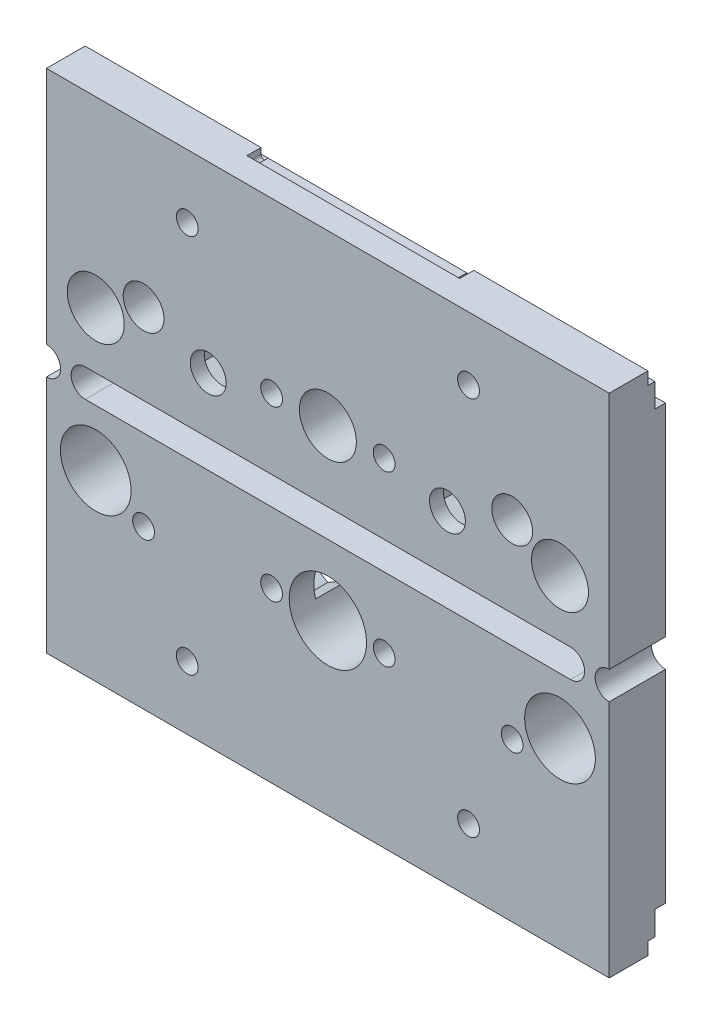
ISO-10303-21;
HEADER;
FILE_DESCRIPTION(('STEP AP214'),'2;1');
FILE_NAME('part.step','',(''),(''),'','','');
FILE_SCHEMA(('AUTOMOTIVE_DESIGN { 1 0 10303 214 1 1 1 1 }'));
ENDSEC;
DATA;
#1=APPLICATION_CONTEXT('core data for automotive mechanical design processes');
#2=APPLICATION_PROTOCOL_DEFINITION('international standard','automotive_design',2000,#1);
#3=PRODUCT_CONTEXT('',#1,'mechanical');
#4=PRODUCT('Part','Part','',(#3));
#5=PRODUCT_RELATED_PRODUCT_CATEGORY('part','',(#4));
#6=PRODUCT_DEFINITION_FORMATION('','',#4);
#7=PRODUCT_DEFINITION_CONTEXT('part definition',#1,'design');
#8=PRODUCT_DEFINITION('design','',#6,#7);
#9=PRODUCT_DEFINITION_SHAPE('','',#8);
#10=(LENGTH_UNIT() NAMED_UNIT(*) SI_UNIT(.MILLI.,.METRE.));
#11=(NAMED_UNIT(*) PLANE_ANGLE_UNIT() SI_UNIT($,.RADIAN.));
#12=(NAMED_UNIT(*) SI_UNIT($,.STERADIAN.) SOLID_ANGLE_UNIT());
#13=UNCERTAINTY_MEASURE_WITH_UNIT(LENGTH_MEASURE(1.E-05),#10,'distance_accuracy_value','');
#14=(GEOMETRIC_REPRESENTATION_CONTEXT(3) GLOBAL_UNCERTAINTY_ASSIGNED_CONTEXT((#13)) GLOBAL_UNIT_ASSIGNED_CONTEXT((#10,
#11,#12)) REPRESENTATION_CONTEXT('',''));
#15=CARTESIAN_POINT('',(0.,0.,0.));
#16=DIRECTION('',(0.,0.,1.));
#17=DIRECTION('',(1.,0.,0.));
#18=AXIS2_PLACEMENT_3D('',#15,#16,#17);
#19=CARTESIAN_POINT('',(57.,8.,0.));
#20=DIRECTION('',(0.,0.,1.));
#21=DIRECTION('',(1.,0.,0.));
#22=AXIS2_PLACEMENT_3D('',#19,#20,#21);
#23=CYLINDRICAL_SURFACE('',#22,2.55);
#24=CARTESIAN_POINT('',(57.,8.,8.));
#25=DIRECTION('',(0.,0.,1.));
#26=DIRECTION('',(1.,0.,0.));
#27=AXIS2_PLACEMENT_3D('',#24,#25,#26);
#28=CIRCLE('',#27,2.55);
#29=CARTESIAN_POINT('',(59.55,8.,8.));
#30=VERTEX_POINT('',#29);
#31=EDGE_CURVE('E802',#30,#30,#28,.T.);
#32=ORIENTED_EDGE('',*,*,#31,.T.);
#33=EDGE_LOOP('',(#32));
#34=FACE_BOUND('',#33,.T.);
#35=CARTESIAN_POINT('',(57.,8.,6.));
#36=DIRECTION('',(0.,0.,-1.));
#37=DIRECTION('',(-1.,0.,0.));
#38=AXIS2_PLACEMENT_3D('',#35,#36,#37);
#39=CIRCLE('',#38,2.55);
#40=CARTESIAN_POINT('',(54.45,8.,6.));
#41=VERTEX_POINT('',#40);
#42=EDGE_CURVE('E873',#41,#41,#39,.F.);
#43=ORIENTED_EDGE('',*,*,#42,.F.);
#44=EDGE_LOOP('',(#43));
#45=FACE_BOUND('',#44,.T.);
#46=ADVANCED_FACE('F33',(#34,#45),#23,.F.);
#47=CARTESIAN_POINT('',(23.,8.,0.));
#48=DIRECTION('',(0.,0.,1.));
#49=DIRECTION('',(1.,0.,0.));
#50=AXIS2_PLACEMENT_3D('',#47,#48,#49);
#51=CYLINDRICAL_SURFACE('',#50,2.55);
#52=CARTESIAN_POINT('',(23.,8.,8.));
#53=DIRECTION('',(0.,0.,1.));
#54=DIRECTION('',(1.,0.,0.));
#55=AXIS2_PLACEMENT_3D('',#52,#53,#54);
#56=CIRCLE('',#55,2.55);
#57=CARTESIAN_POINT('',(25.55,8.,8.));
#58=VERTEX_POINT('',#57);
#59=EDGE_CURVE('E812',#58,#58,#56,.T.);
#60=ORIENTED_EDGE('',*,*,#59,.T.);
#61=EDGE_LOOP('',(#60));
#62=FACE_BOUND('',#61,.T.);
#63=CARTESIAN_POINT('',(23.,8.,6.));
#64=DIRECTION('',(0.,0.,-1.));
#65=DIRECTION('',(-1.,0.,0.));
#66=AXIS2_PLACEMENT_3D('',#63,#64,#65);
#67=CIRCLE('',#66,2.55);
#68=CARTESIAN_POINT('',(20.45,8.,6.));
#69=VERTEX_POINT('',#68);
#70=EDGE_CURVE('E871',#69,#69,#67,.F.);
#71=ORIENTED_EDGE('',*,*,#70,.F.);
#72=EDGE_LOOP('',(#71));
#73=FACE_BOUND('',#72,.T.);
#74=ADVANCED_FACE('F1188',(#62,#73),#51,.F.);
#75=CARTESIAN_POINT('',(80.,-38.,8.));
#76=DIRECTION('',(0.,-1.,0.));
#77=DIRECTION('',(1.,0.,0.));
#78=AXIS2_PLACEMENT_3D('',#75,#76,#77);
#79=PLANE('',#78);
#80=DIRECTION('',(1.,0.,0.));
#81=VECTOR('',#80,1.);
#82=CARTESIAN_POINT('',(-4.8988590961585E-11,-38.,2.5));
#83=LINE('',#82,#81);
#84=CARTESIAN_POINT('',(-4.8988590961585E-11,-38.,2.5));
#85=VERTEX_POINT('',#84);
#86=CARTESIAN_POINT('',(25.000000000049,-38.,2.49999999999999));
#87=VERTEX_POINT('',#86);
#88=EDGE_CURVE('E540',#85,#87,#83,.T.);
#89=ORIENTED_EDGE('',*,*,#88,.T.);
#90=DIRECTION('',(0.,0.,-1.));
#91=VECTOR('',#90,1.);
#92=CARTESIAN_POINT('',(25.000000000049,-38.,4.49999999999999));
#93=LINE('',#92,#91);
#94=CARTESIAN_POINT('',(25.000000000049,-38.,4.49999999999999));
#95=VERTEX_POINT('',#94);
#96=EDGE_CURVE('E938',#95,#87,#93,.T.);
#97=ORIENTED_EDGE('',*,*,#96,.F.);
#98=DIRECTION('',(1.,0.,0.));
#99=VECTOR('',#98,1.);
#100=CARTESIAN_POINT('',(25.000000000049,-38.,4.49999999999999));
#101=LINE('',#100,#99);
#102=CARTESIAN_POINT('',(55.247938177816,-38.,4.49999999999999));
#103=VERTEX_POINT('',#102);
#104=EDGE_CURVE('E921',#95,#103,#101,.T.);
#105=ORIENTED_EDGE('',*,*,#104,.T.);
#106=DIRECTION('',(0.,0.,-1.));
#107=VECTOR('',#106,1.);
#108=CARTESIAN_POINT('',(55.247938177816,-38.,4.49999999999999));
#109=LINE('',#108,#107);
#110=CARTESIAN_POINT('',(55.247938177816,-38.,2.49999999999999));
#111=VERTEX_POINT('',#110);
#112=EDGE_CURVE('E941',#103,#111,#109,.T.);
#113=ORIENTED_EDGE('',*,*,#112,.T.);
#114=CARTESIAN_POINT('',(80.,-38.,2.5));
#115=VERTEX_POINT('',#114);
#116=EDGE_CURVE('E544',#111,#115,#83,.T.);
#117=ORIENTED_EDGE('',*,*,#116,.T.);
#118=DIRECTION('',(0.,0.,-1.));
#119=VECTOR('',#118,1.);
#120=CARTESIAN_POINT('',(80.,-38.,8.));
#121=LINE('',#120,#119);
#122=CARTESIAN_POINT('',(80.,-38.,8.));
#123=VERTEX_POINT('',#122);
#124=EDGE_CURVE('E563',#123,#115,#121,.T.);
#125=ORIENTED_EDGE('',*,*,#124,.F.);
#126=DIRECTION('',(-1.,0.,0.));
#127=VECTOR('',#126,1.);
#128=CARTESIAN_POINT('',(80.,-38.,8.));
#129=LINE('',#128,#127);
#130=CARTESIAN_POINT('',(0.,-38.,8.));
#131=VERTEX_POINT('',#130);
#132=EDGE_CURVE('E554',#123,#131,#129,.T.);
#133=ORIENTED_EDGE('',*,*,#132,.T.);
#134=DIRECTION('',(0.,0.,-1.));
#135=VECTOR('',#134,1.);
#136=CARTESIAN_POINT('',(0.,-38.,8.));
#137=LINE('',#136,#135);
#138=EDGE_CURVE('E572',#131,#85,#137,.T.);
#139=ORIENTED_EDGE('',*,*,#138,.T.);
#140=EDGE_LOOP('',(#89,#97,#105,#113,#117,#125,#133,#139));
#141=FACE_BOUND('',#140,.T.);
#142=ADVANCED_FACE('F1158',(#141),#79,.T.);
#143=CARTESIAN_POINT('',(0.,0.,0.));
#144=DIRECTION('',(0.,0.,1.));
#145=DIRECTION('',(1.,0.,0.));
#146=AXIS2_PLACEMENT_3D('',#143,#144,#145);
#147=PLANE('',#146);
#148=DIRECTION('',(0.,1.,0.));
#149=VECTOR('',#148,1.);
#150=CARTESIAN_POINT('',(52.9,5.63286389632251,0.));
#151=LINE('',#150,#149);
#152=CARTESIAN_POINT('',(52.9,5.63286389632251,0.));
#153=VERTEX_POINT('',#152);
#154=CARTESIAN_POINT('',(52.9,10.3671361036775,0.));
#155=VERTEX_POINT('',#154);
#156=EDGE_CURVE('E1074',#153,#155,#151,.T.);
#157=ORIENTED_EDGE('',*,*,#156,.F.);
#158=DIRECTION('',(-0.866025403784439,0.5,0.));
#159=VECTOR('',#158,1.);
#160=CARTESIAN_POINT('',(57.,3.26572779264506,0.));
#161=LINE('',#160,#159);
#162=CARTESIAN_POINT('',(57.,3.26572779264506,0.));
#163=VERTEX_POINT('',#162);
#164=EDGE_CURVE('E55',#163,#153,#161,.T.);
#165=ORIENTED_EDGE('',*,*,#164,.F.);
#166=DIRECTION('',(-0.866025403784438,-0.5,0.));
#167=VECTOR('',#166,1.);
#168=CARTESIAN_POINT('',(61.1,5.63286389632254,0.));
#169=LINE('',#168,#167);
#170=CARTESIAN_POINT('',(61.1,5.63286389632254,0.));
#171=VERTEX_POINT('',#170);
#172=EDGE_CURVE('E1057',#171,#163,#169,.T.);
#173=ORIENTED_EDGE('',*,*,#172,.F.);
#174=DIRECTION('',(0.,-1.,0.));
#175=VECTOR('',#174,1.);
#176=CARTESIAN_POINT('',(61.1,10.3671361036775,0.));
#177=LINE('',#176,#175);
#178=CARTESIAN_POINT('',(61.1,10.3671361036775,0.));
#179=VERTEX_POINT('',#178);
#180=EDGE_CURVE('E1084',#179,#171,#177,.T.);
#181=ORIENTED_EDGE('',*,*,#180,.F.);
#182=DIRECTION('',(0.866025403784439,-0.5,0.));
#183=VECTOR('',#182,1.);
#184=CARTESIAN_POINT('',(57.,12.7342722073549,0.));
#185=LINE('',#184,#183);
#186=CARTESIAN_POINT('',(57.,12.7342722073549,0.));
#187=VERTEX_POINT('',#186);
#188=EDGE_CURVE('E1081',#187,#179,#185,.T.);
#189=ORIENTED_EDGE('',*,*,#188,.F.);
#190=DIRECTION('',(0.866025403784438,0.5,0.));
#191=VECTOR('',#190,1.);
#192=CARTESIAN_POINT('',(52.9,10.3671361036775,0.));
#193=LINE('',#192,#191);
#194=EDGE_CURVE('E1078',#155,#187,#193,.T.);
#195=ORIENTED_EDGE('',*,*,#194,.F.);
#196=EDGE_LOOP('',(#157,#165,#173,#181,#189,#195));
#197=FACE_BOUND('',#196,.T.);
#198=DIRECTION('',(0.,1.,0.));
#199=VECTOR('',#198,1.);
#200=CARTESIAN_POINT('',(18.9,5.63286389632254,0.));
#201=LINE('',#200,#199);
#202=CARTESIAN_POINT('',(18.9,5.63286389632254,0.));
#203=VERTEX_POINT('',#202);
#204=CARTESIAN_POINT('',(18.9,10.3671361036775,0.));
#205=VERTEX_POINT('',#204);
#206=EDGE_CURVE('E1048',#203,#205,#201,.T.);
#207=ORIENTED_EDGE('',*,*,#206,.F.);
#208=DIRECTION('',(-0.866025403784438,0.5,0.));
#209=VECTOR('',#208,1.);
#210=CARTESIAN_POINT('',(23.,3.26572779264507,0.));
#211=LINE('',#210,#209);
#212=CARTESIAN_POINT('',(23.,3.26572779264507,0.));
#213=VERTEX_POINT('',#212);
#214=EDGE_CURVE('E1046',#213,#203,#211,.T.);
#215=ORIENTED_EDGE('',*,*,#214,.F.);
#216=DIRECTION('',(-0.866025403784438,-0.5,0.));
#217=VECTOR('',#216,1.);
#218=CARTESIAN_POINT('',(27.1,5.63286389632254,0.));
#219=LINE('',#218,#217);
#220=CARTESIAN_POINT('',(27.1,5.63286389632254,0.));
#221=VERTEX_POINT('',#220);
#222=EDGE_CURVE('E1103',#221,#213,#219,.T.);
#223=ORIENTED_EDGE('',*,*,#222,.F.);
#224=DIRECTION('',(0.,-1.,0.));
#225=VECTOR('',#224,1.);
#226=CARTESIAN_POINT('',(27.1,10.3671361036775,0.));
#227=LINE('',#226,#225);
#228=CARTESIAN_POINT('',(27.1,10.3671361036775,0.));
#229=VERTEX_POINT('',#228);
#230=EDGE_CURVE('E1127',#229,#221,#227,.T.);
#231=ORIENTED_EDGE('',*,*,#230,.F.);
#232=DIRECTION('',(0.866025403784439,-0.5,0.));
#233=VECTOR('',#232,1.);
#234=CARTESIAN_POINT('',(23.,12.7342722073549,0.));
#235=LINE('',#234,#233);
#236=CARTESIAN_POINT('',(23.,12.7342722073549,0.));
#237=VERTEX_POINT('',#236);
#238=EDGE_CURVE('E1124',#237,#229,#235,.T.);
#239=ORIENTED_EDGE('',*,*,#238,.F.);
#240=DIRECTION('',(0.866025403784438,0.5,0.));
#241=VECTOR('',#240,1.);
#242=CARTESIAN_POINT('',(18.9,10.3671361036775,0.));
#243=LINE('',#242,#241);
#244=EDGE_CURVE('E1121',#205,#237,#243,.T.);
#245=ORIENTED_EDGE('',*,*,#244,.F.);
#246=EDGE_LOOP('',(#207,#215,#223,#231,#239,#245));
#247=FACE_BOUND('',#246,.T.);
#248=CARTESIAN_POINT('',(13.8,11.4999999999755,0.));
#249=DIRECTION('',(0.,0.,-1.));
#250=DIRECTION('',(1.,0.,0.));
#251=AXIS2_PLACEMENT_3D('',#248,#249,#250);
#252=CIRCLE('',#251,2.9);
#253=CARTESIAN_POINT('',(16.7,11.4999999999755,0.));
#254=VERTEX_POINT('',#253);
#255=EDGE_CURVE('E876',#254,#254,#252,.T.);
#256=ORIENTED_EDGE('',*,*,#255,.F.);
#257=EDGE_LOOP('',(#256));
#258=FACE_BOUND('',#257,.T.);
#259=CARTESIAN_POINT('',(13.8,-15.5,0.));
#260=DIRECTION('',(0.,0.,-1.));
#261=DIRECTION('',(1.,0.,0.));
#262=AXIS2_PLACEMENT_3D('',#259,#260,#261);
#263=CIRCLE('',#262,1.54999999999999);
#264=CARTESIAN_POINT('',(15.35,-15.5,0.));
#265=VERTEX_POINT('',#264);
#266=EDGE_CURVE('E885',#265,#265,#263,.T.);
#267=ORIENTED_EDGE('',*,*,#266,.F.);
#268=EDGE_LOOP('',(#267));
#269=FACE_BOUND('',#268,.T.);
#270=CARTESIAN_POINT('',(66.2,-15.5,0.));
#271=DIRECTION('',(0.,0.,-1.));
#272=DIRECTION('',(-1.,0.,0.));
#273=AXIS2_PLACEMENT_3D('',#270,#271,#272);
#274=CIRCLE('',#273,1.54999999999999);
#275=CARTESIAN_POINT('',(64.65,-15.5,0.));
#276=VERTEX_POINT('',#275);
#277=EDGE_CURVE('E1145',#276,#276,#274,.T.);
#278=ORIENTED_EDGE('',*,*,#277,.F.);
#279=EDGE_LOOP('',(#278));
#280=FACE_BOUND('',#279,.T.);
#281=CARTESIAN_POINT('',(66.2,11.4999999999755,0.));
#282=DIRECTION('',(0.,0.,-1.));
#283=DIRECTION('',(-1.,0.,0.));
#284=AXIS2_PLACEMENT_3D('',#281,#282,#283);
#285=CIRCLE('',#284,2.9);
#286=CARTESIAN_POINT('',(63.3,11.4999999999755,0.));
#287=VERTEX_POINT('',#286);
#288=EDGE_CURVE('E893',#287,#287,#285,.T.);
#289=ORIENTED_EDGE('',*,*,#288,.F.);
#290=EDGE_LOOP('',(#289));
#291=FACE_BOUND('',#290,.T.);
#292=CARTESIAN_POINT('',(73.,-12.,0.));
#293=DIRECTION('',(0.,0.,-1.));
#294=DIRECTION('',(-1.,0.,0.));
#295=AXIS2_PLACEMENT_3D('',#292,#293,#294);
#296=CIRCLE('',#295,5.025);
#297=CARTESIAN_POINT('',(67.975,-12.,0.));
#298=VERTEX_POINT('',#297);
#299=EDGE_CURVE('E901',#298,#298,#296,.T.);
#300=ORIENTED_EDGE('',*,*,#299,.F.);
#301=EDGE_LOOP('',(#300));
#302=FACE_BOUND('',#301,.T.);
#303=CARTESIAN_POINT('',(7.,-12.,0.));
#304=DIRECTION('',(0.,0.,-1.));
#305=DIRECTION('',(-1.,0.,0.));
#306=AXIS2_PLACEMENT_3D('',#303,#304,#305);
#307=CIRCLE('',#306,5.025);
#308=CARTESIAN_POINT('',(1.975,-12.,0.));
#309=VERTEX_POINT('',#308);
#310=EDGE_CURVE('E892',#309,#309,#307,.T.);
#311=ORIENTED_EDGE('',*,*,#310,.F.);
#312=EDGE_LOOP('',(#311));
#313=FACE_BOUND('',#312,.T.);
#314=CARTESIAN_POINT('',(60.,-29.,0.));
#315=DIRECTION('',(0.,0.,1.));
#316=DIRECTION('',(-1.,0.,0.));
#317=AXIS2_PLACEMENT_3D('',#314,#315,#316);
#318=CIRCLE('',#317,1.55);
#319=CARTESIAN_POINT('',(58.45,-29.,0.));
#320=VERTEX_POINT('',#319);
#321=EDGE_CURVE('E490',#320,#320,#318,.T.);
#322=ORIENTED_EDGE('',*,*,#321,.T.);
#323=EDGE_LOOP('',(#322));
#324=FACE_BOUND('',#323,.T.);
#325=CARTESIAN_POINT('',(19.9999999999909,-29.0000000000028,0.));
#326=DIRECTION('',(0.,0.,1.));
#327=DIRECTION('',(-1.,0.,0.));
#328=AXIS2_PLACEMENT_3D('',#325,#326,#327);
#329=CIRCLE('',#328,1.55);
#330=CARTESIAN_POINT('',(18.4499999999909,-29.0000000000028,0.));
#331=VERTEX_POINT('',#330);
#332=EDGE_CURVE('E940',#331,#331,#329,.T.);
#333=ORIENTED_EDGE('',*,*,#332,.T.);
#334=EDGE_LOOP('',(#333));
#335=FACE_BOUND('',#334,.T.);
#336=DIRECTION('',(-0.866025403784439,-0.5,0.));
#337=VECTOR('',#336,1.);
#338=CARTESIAN_POINT('',(48.,-10.7091034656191,0.));
#339=LINE('',#338,#337);
#340=CARTESIAN_POINT('',(48.,-10.7091034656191,0.));
#341=VERTEX_POINT('',#340);
#342=CARTESIAN_POINT('',(45.2328562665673,-12.3067146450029,0.));
#343=VERTEX_POINT('',#342);
#344=EDGE_CURVE('E475',#341,#343,#339,.T.);
#345=ORIENTED_EDGE('',*,*,#344,.T.);
#346=CARTESIAN_POINT('',(40.,-14.,0.));
#347=DIRECTION('',(0.,0.,-1.));
#348=DIRECTION('',(-1.,0.,0.));
#349=AXIS2_PLACEMENT_3D('',#346,#347,#348);
#350=CIRCLE('',#349,5.5);
#351=CARTESIAN_POINT('',(34.7671437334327,-12.3067146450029,0.));
#352=VERTEX_POINT('',#351);
#353=EDGE_CURVE('E459',#352,#343,#350,.T.);
#354=ORIENTED_EDGE('',*,*,#353,.F.);
#355=DIRECTION('',(-0.866025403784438,0.5,0.));
#356=VECTOR('',#355,1.);
#357=CARTESIAN_POINT('',(34.85,-12.3545517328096,0.));
#358=LINE('',#357,#356);
#359=CARTESIAN_POINT('',(32.,-10.7091034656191,0.));
#360=VERTEX_POINT('',#359);
#361=EDGE_CURVE('E471',#352,#360,#358,.T.);
#362=ORIENTED_EDGE('',*,*,#361,.T.);
#363=DIRECTION('',(-0.866025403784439,-0.499999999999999,0.));
#364=VECTOR('',#363,1.);
#365=CARTESIAN_POINT('',(32.,-10.7091034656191,0.));
#366=LINE('',#365,#364);
#367=CARTESIAN_POINT('',(29.15,-12.3545517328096,0.));
#368=VERTEX_POINT('',#367);
#369=EDGE_CURVE('E501',#360,#368,#366,.T.);
#370=ORIENTED_EDGE('',*,*,#369,.T.);
#371=DIRECTION('',(0.,-1.,0.));
#372=VECTOR('',#371,1.);
#373=CARTESIAN_POINT('',(29.15,-12.3545517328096,0.));
#374=LINE('',#373,#372);
#375=CARTESIAN_POINT('',(29.15,-15.6454482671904,0.));
#376=VERTEX_POINT('',#375);
#377=EDGE_CURVE('E498',#368,#376,#374,.T.);
#378=ORIENTED_EDGE('',*,*,#377,.T.);
#379=DIRECTION('',(0.866025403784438,-0.500000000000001,0.));
#380=VECTOR('',#379,1.);
#381=CARTESIAN_POINT('',(29.15,-15.6454482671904,0.));
#382=LINE('',#381,#380);
#383=CARTESIAN_POINT('',(32.,-17.2908965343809,0.));
#384=VERTEX_POINT('',#383);
#385=EDGE_CURVE('E487',#376,#384,#382,.T.);
#386=ORIENTED_EDGE('',*,*,#385,.T.);
#387=DIRECTION('',(0.866025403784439,0.499999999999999,0.));
#388=VECTOR('',#387,1.);
#389=CARTESIAN_POINT('',(32.,-17.2908965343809,0.));
#390=LINE('',#389,#388);
#391=CARTESIAN_POINT('',(34.7671437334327,-15.6932853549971,0.));
#392=VERTEX_POINT('',#391);
#393=EDGE_CURVE('E483',#384,#392,#390,.T.);
#394=ORIENTED_EDGE('',*,*,#393,.T.);
#395=CARTESIAN_POINT('',(45.2328562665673,-15.6932853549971,0.));
#396=VERTEX_POINT('',#395);
#397=EDGE_CURVE('E477',#396,#392,#350,.T.);
#398=ORIENTED_EDGE('',*,*,#397,.F.);
#399=DIRECTION('',(0.866025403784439,-0.5,0.));
#400=VECTOR('',#399,1.);
#401=CARTESIAN_POINT('',(45.15,-15.6454482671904,0.));
#402=LINE('',#401,#400);
#403=CARTESIAN_POINT('',(48.,-17.2908965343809,0.));
#404=VERTEX_POINT('',#403);
#405=EDGE_CURVE('E975',#396,#404,#402,.T.);
#406=ORIENTED_EDGE('',*,*,#405,.T.);
#407=DIRECTION('',(0.866025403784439,0.5,0.));
#408=VECTOR('',#407,1.);
#409=CARTESIAN_POINT('',(48.,-17.2908965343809,0.));
#410=LINE('',#409,#408);
#411=CARTESIAN_POINT('',(50.85,-15.6454482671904,0.));
#412=VERTEX_POINT('',#411);
#413=EDGE_CURVE('E505',#404,#412,#410,.T.);
#414=ORIENTED_EDGE('',*,*,#413,.T.);
#415=DIRECTION('',(0.,1.,0.));
#416=VECTOR('',#415,1.);
#417=CARTESIAN_POINT('',(50.85,-15.6454482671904,0.));
#418=LINE('',#417,#416);
#419=CARTESIAN_POINT('',(50.85,-12.3545517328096,0.));
#420=VERTEX_POINT('',#419);
#421=EDGE_CURVE('E963',#412,#420,#418,.T.);
#422=ORIENTED_EDGE('',*,*,#421,.T.);
#423=DIRECTION('',(-0.866025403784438,0.5,0.));
#424=VECTOR('',#423,1.);
#425=CARTESIAN_POINT('',(50.85,-12.3545517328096,0.));
#426=LINE('',#425,#424);
#427=EDGE_CURVE('E978',#420,#341,#426,.T.);
#428=ORIENTED_EDGE('',*,*,#427,.T.);
#429=EDGE_LOOP('',(#345,#354,#362,#370,#378,#386,#394,#398,#406,#414,#422,#428));
#430=FACE_BOUND('',#429,.T.);
#431=CARTESIAN_POINT('',(73.,8.,0.));
#432=DIRECTION('',(0.,0.,1.));
#433=DIRECTION('',(1.,0.,0.));
#434=AXIS2_PLACEMENT_3D('',#431,#432,#433);
#435=CIRCLE('',#434,4.05);
#436=CARTESIAN_POINT('',(77.05,8.,0.));
#437=VERTEX_POINT('',#436);
#438=EDGE_CURVE('E815',#437,#437,#435,.T.);
#439=ORIENTED_EDGE('',*,*,#438,.T.);
#440=EDGE_LOOP('',(#439));
#441=FACE_BOUND('',#440,.T.);
#442=CARTESIAN_POINT('',(40.,10.,0.));
#443=DIRECTION('',(0.,0.,1.));
#444=DIRECTION('',(1.,0.,0.));
#445=AXIS2_PLACEMENT_3D('',#442,#443,#444);
#446=CIRCLE('',#445,4.05);
#447=CARTESIAN_POINT('',(44.05,10.,0.));
#448=VERTEX_POINT('',#447);
#449=EDGE_CURVE('E821',#448,#448,#446,.T.);
#450=ORIENTED_EDGE('',*,*,#449,.T.);
#451=EDGE_LOOP('',(#450));
#452=FACE_BOUND('',#451,.T.);
#453=CARTESIAN_POINT('',(7.,8.,0.));
#454=DIRECTION('',(0.,0.,1.));
#455=DIRECTION('',(1.,0.,0.));
#456=AXIS2_PLACEMENT_3D('',#453,#454,#455);
#457=CIRCLE('',#456,4.05);
#458=CARTESIAN_POINT('',(11.05,8.,0.));
#459=VERTEX_POINT('',#458);
#460=EDGE_CURVE('E827',#459,#459,#457,.T.);
#461=ORIENTED_EDGE('',*,*,#460,.T.);
#462=EDGE_LOOP('',(#461));
#463=FACE_BOUND('',#462,.T.);
#464=DIRECTION('',(1.,0.,0.));
#465=VECTOR('',#464,1.);
#466=CARTESIAN_POINT('',(0.,-4.,0.));
#467=LINE('',#466,#465);
#468=CARTESIAN_POINT('',(5.49999999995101,-4.,0.));
#469=VERTEX_POINT('',#468);
#470=CARTESIAN_POINT('',(74.5,-4.,0.));
#471=VERTEX_POINT('',#470);
#472=EDGE_CURVE('E555',#469,#471,#467,.T.);
#473=ORIENTED_EDGE('',*,*,#472,.T.);
#474=CARTESIAN_POINT('',(74.5,-2.00000000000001,0.));
#475=DIRECTION('',(0.,0.,-1.));
#476=DIRECTION('',(1.,0.,0.));
#477=AXIS2_PLACEMENT_3D('',#474,#475,#476);
#478=CIRCLE('',#477,2.00000000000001);
#479=CARTESIAN_POINT('',(74.5,0.,0.));
#480=VERTEX_POINT('',#479);
#481=EDGE_CURVE('E598',#480,#471,#478,.T.);
#482=ORIENTED_EDGE('',*,*,#481,.F.);
#483=DIRECTION('',(1.,0.,0.));
#484=VECTOR('',#483,1.);
#485=CARTESIAN_POINT('',(0.,0.,0.));
#486=LINE('',#485,#484);
#487=CARTESIAN_POINT('',(5.49999999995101,0.,0.));
#488=VERTEX_POINT('',#487);
#489=EDGE_CURVE('E847',#488,#480,#486,.T.);
#490=ORIENTED_EDGE('',*,*,#489,.F.);
#491=CARTESIAN_POINT('',(5.49999999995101,-2.00000000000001,0.));
#492=DIRECTION('',(0.,0.,-1.));
#493=DIRECTION('',(1.,0.,0.));
#494=AXIS2_PLACEMENT_3D('',#491,#492,#493);
#495=CIRCLE('',#494,2.);
#496=EDGE_CURVE('E576',#469,#488,#495,.T.);
#497=ORIENTED_EDGE('',*,*,#496,.F.);
#498=EDGE_LOOP('',(#473,#482,#490,#497));
#499=FACE_BOUND('',#498,.T.);
#500=DIRECTION('',(-0.866025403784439,0.499999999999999,0.));
#501=VECTOR('',#500,1.);
#502=CARTESIAN_POINT('',(32.,6.70910346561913,0.));
#503=LINE('',#502,#501);
#504=CARTESIAN_POINT('',(32.,6.70910346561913,0.));
#505=VERTEX_POINT('',#504);
#506=CARTESIAN_POINT('',(29.15,8.35455173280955,0.));
#507=VERTEX_POINT('',#506);
#508=EDGE_CURVE('E748',#505,#507,#503,.T.);
#509=ORIENTED_EDGE('',*,*,#508,.F.);
#510=DIRECTION('',(-0.866025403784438,-0.5,0.));
#511=VECTOR('',#510,1.);
#512=CARTESIAN_POINT('',(34.85,8.35455173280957,0.));
#513=LINE('',#512,#511);
#514=CARTESIAN_POINT('',(34.85,8.35455173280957,0.));
#515=VERTEX_POINT('',#514);
#516=EDGE_CURVE('E695',#515,#505,#513,.T.);
#517=ORIENTED_EDGE('',*,*,#516,.F.);
#518=DIRECTION('',(0.,-1.,0.));
#519=VECTOR('',#518,1.);
#520=CARTESIAN_POINT('',(34.85,11.6454482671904,0.));
#521=LINE('',#520,#519);
#522=CARTESIAN_POINT('',(34.85,11.6454482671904,0.));
#523=VERTEX_POINT('',#522);
#524=EDGE_CURVE('E735',#523,#515,#521,.T.);
#525=ORIENTED_EDGE('',*,*,#524,.F.);
#526=DIRECTION('',(0.866025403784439,-0.499999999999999,0.));
#527=VECTOR('',#526,1.);
#528=CARTESIAN_POINT('',(32.,13.2908965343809,0.));
#529=LINE('',#528,#527);
#530=CARTESIAN_POINT('',(32.,13.2908965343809,0.));
#531=VERTEX_POINT('',#530);
#532=EDGE_CURVE('E738',#531,#523,#529,.T.);
#533=ORIENTED_EDGE('',*,*,#532,.F.);
#534=DIRECTION('',(0.866025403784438,0.500000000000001,0.));
#535=VECTOR('',#534,1.);
#536=CARTESIAN_POINT('',(29.15,11.6454482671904,0.));
#537=LINE('',#536,#535);
#538=CARTESIAN_POINT('',(29.15,11.6454482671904,0.));
#539=VERTEX_POINT('',#538);
#540=EDGE_CURVE('E742',#539,#531,#537,.T.);
#541=ORIENTED_EDGE('',*,*,#540,.F.);
#542=DIRECTION('',(0.,1.,0.));
#543=VECTOR('',#542,1.);
#544=CARTESIAN_POINT('',(29.15,8.35455173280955,0.));
#545=LINE('',#544,#543);
#546=EDGE_CURVE('E745',#507,#539,#545,.T.);
#547=ORIENTED_EDGE('',*,*,#546,.F.);
#548=EDGE_LOOP('',(#509,#517,#525,#533,#541,#547));
#549=FACE_BOUND('',#548,.T.);
#550=DIRECTION('',(0.,-1.,0.));
#551=VECTOR('',#550,1.);
#552=CARTESIAN_POINT('',(50.85,11.6454482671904,0.));
#553=LINE('',#552,#551);
#554=CARTESIAN_POINT('',(50.85,11.6454482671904,0.));
#555=VERTEX_POINT('',#554);
#556=CARTESIAN_POINT('',(50.85,8.35455173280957,0.));
#557=VERTEX_POINT('',#556);
#558=EDGE_CURVE('E694',#555,#557,#553,.T.);
#559=ORIENTED_EDGE('',*,*,#558,.F.);
#560=DIRECTION('',(0.866025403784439,-0.5,0.));
#561=VECTOR('',#560,1.);
#562=CARTESIAN_POINT('',(48.,13.2908965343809,0.));
#563=LINE('',#562,#561);
#564=CARTESIAN_POINT('',(48.,13.2908965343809,0.));
#565=VERTEX_POINT('',#564);
#566=EDGE_CURVE('E692',#565,#555,#563,.T.);
#567=ORIENTED_EDGE('',*,*,#566,.F.);
#568=DIRECTION('',(0.866025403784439,0.5,0.));
#569=VECTOR('',#568,1.);
#570=CARTESIAN_POINT('',(45.15,11.6454482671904,0.));
#571=LINE('',#570,#569);
#572=CARTESIAN_POINT('',(45.15,11.6454482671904,0.));
#573=VERTEX_POINT('',#572);
#574=EDGE_CURVE('E676',#573,#565,#571,.T.);
#575=ORIENTED_EDGE('',*,*,#574,.F.);
#576=DIRECTION('',(0.,1.,0.));
#577=VECTOR('',#576,1.);
#578=CARTESIAN_POINT('',(45.15,8.35455173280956,0.));
#579=LINE('',#578,#577);
#580=CARTESIAN_POINT('',(45.15,8.35455173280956,0.));
#581=VERTEX_POINT('',#580);
#582=EDGE_CURVE('E704',#581,#573,#579,.T.);
#583=ORIENTED_EDGE('',*,*,#582,.F.);
#584=DIRECTION('',(-0.866025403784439,0.5,0.));
#585=VECTOR('',#584,1.);
#586=CARTESIAN_POINT('',(48.,6.70910346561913,0.));
#587=LINE('',#586,#585);
#588=CARTESIAN_POINT('',(48.,6.70910346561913,0.));
#589=VERTEX_POINT('',#588);
#590=EDGE_CURVE('E701',#589,#581,#587,.T.);
#591=ORIENTED_EDGE('',*,*,#590,.F.);
#592=DIRECTION('',(-0.866025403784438,-0.5,0.));
#593=VECTOR('',#592,1.);
#594=CARTESIAN_POINT('',(50.85,8.35455173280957,0.));
#595=LINE('',#594,#593);
#596=EDGE_CURVE('E698',#557,#589,#595,.T.);
#597=ORIENTED_EDGE('',*,*,#596,.F.);
#598=EDGE_LOOP('',(#559,#567,#575,#583,#591,#597));
#599=FACE_BOUND('',#598,.T.);
#600=CARTESIAN_POINT('',(19.9999999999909,25.0000000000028,0.));
#601=DIRECTION('',(0.,0.,-1.));
#602=DIRECTION('',(-1.,0.,0.));
#603=AXIS2_PLACEMENT_3D('',#600,#601,#602);
#604=CIRCLE('',#603,1.55);
#605=CARTESIAN_POINT('',(18.4499999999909,25.0000000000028,0.));
#606=VERTEX_POINT('',#605);
#607=EDGE_CURVE('E649',#606,#606,#604,.T.);
#608=ORIENTED_EDGE('',*,*,#607,.F.);
#609=EDGE_LOOP('',(#608));
#610=FACE_BOUND('',#609,.T.);
#611=CARTESIAN_POINT('',(60.,25.,0.));
#612=DIRECTION('',(0.,0.,-1.));
#613=DIRECTION('',(-1.,0.,0.));
#614=AXIS2_PLACEMENT_3D('',#611,#612,#613);
#615=CIRCLE('',#614,1.55);
#616=CARTESIAN_POINT('',(58.45,25.,0.));
#617=VERTEX_POINT('',#616);
#618=EDGE_CURVE('E664',#617,#617,#615,.T.);
#619=ORIENTED_EDGE('',*,*,#618,.F.);
#620=EDGE_LOOP('',(#619));
#621=FACE_BOUND('',#620,.T.);
#622=DIRECTION('',(1.,0.,0.));
#623=VECTOR('',#622,1.);
#624=CARTESIAN_POINT('',(-4.8988590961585E-11,-32.7999999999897,0.));
#625=LINE('',#624,#623);
#626=CARTESIAN_POINT('',(-4.8988590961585E-11,-32.7999999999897,0.));
#627=VERTEX_POINT('',#626);
#628=CARTESIAN_POINT('',(80.,-32.7999999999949,0.));
#629=VERTEX_POINT('',#628);
#630=EDGE_CURVE('E529',#627,#629,#625,.T.);
#631=ORIENTED_EDGE('',*,*,#630,.F.);
#632=DIRECTION('',(0.,1.,0.));
#633=VECTOR('',#632,1.);
#634=CARTESIAN_POINT('',(0.,-38.,0.));
#635=LINE('',#634,#633);
#636=CARTESIAN_POINT('',(0.,-4.,0.));
#637=VERTEX_POINT('',#636);
#638=EDGE_CURVE('E543',#627,#637,#635,.T.);
#639=ORIENTED_EDGE('',*,*,#638,.T.);
#640=CARTESIAN_POINT('',(-4.89859888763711E-11,-2.00000000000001,0.));
#641=DIRECTION('',(0.,0.,-1.));
#642=DIRECTION('',(1.,0.,0.));
#643=AXIS2_PLACEMENT_3D('',#640,#641,#642);
#644=CIRCLE('',#643,2.);
#645=CARTESIAN_POINT('',(-4.89858664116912E-11,0.,0.));
#646=VERTEX_POINT('',#645);
#647=EDGE_CURVE('E579',#646,#637,#644,.T.);
#648=ORIENTED_EDGE('',*,*,#647,.F.);
#649=DIRECTION('',(0.,-1.,0.));
#650=VECTOR('',#649,1.);
#651=CARTESIAN_POINT('',(0.,34.,0.));
#652=LINE('',#651,#650);
#653=CARTESIAN_POINT('',(0.,28.7999999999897,0.));
#654=VERTEX_POINT('',#653);
#655=EDGE_CURVE('E833',#654,#646,#652,.T.);
#656=ORIENTED_EDGE('',*,*,#655,.F.);
#657=DIRECTION('',(1.,0.,0.));
#658=VECTOR('',#657,1.);
#659=CARTESIAN_POINT('',(0.,28.7999999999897,0.));
#660=LINE('',#659,#658);
#661=CARTESIAN_POINT('',(80.,28.7999999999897,0.));
#662=VERTEX_POINT('',#661);
#663=EDGE_CURVE('E799',#654,#662,#660,.T.);
#664=ORIENTED_EDGE('',*,*,#663,.T.);
#665=DIRECTION('',(0.,1.,0.));
#666=VECTOR('',#665,1.);
#667=CARTESIAN_POINT('',(80.,0.,0.));
#668=LINE('',#667,#666);
#669=CARTESIAN_POINT('',(80.,0.,0.));
#670=VERTEX_POINT('',#669);
#671=EDGE_CURVE('E839',#670,#662,#668,.T.);
#672=ORIENTED_EDGE('',*,*,#671,.F.);
#673=CARTESIAN_POINT('',(80.,-2.,0.));
#674=DIRECTION('',(0.,0.,-1.));
#675=DIRECTION('',(1.,0.,0.));
#676=AXIS2_PLACEMENT_3D('',#673,#674,#675);
#677=CIRCLE('',#676,2.);
#678=CARTESIAN_POINT('',(80.,-4.,0.));
#679=VERTEX_POINT('',#678);
#680=EDGE_CURVE('E596',#679,#670,#677,.T.);
#681=ORIENTED_EDGE('',*,*,#680,.F.);
#682=DIRECTION('',(0.,-1.,0.));
#683=VECTOR('',#682,1.);
#684=CARTESIAN_POINT('',(80.,-4.,0.));
#685=LINE('',#684,#683);
#686=EDGE_CURVE('E565',#679,#629,#685,.T.);
#687=ORIENTED_EDGE('',*,*,#686,.T.);
#688=EDGE_LOOP('',(#631,#639,#648,#656,#664,#672,#681,#687));
#689=FACE_BOUND('',#688,.T.);
#690=ADVANCED_FACE('F468',(#197,#247,#258,#269,#280,#291,#302,#313,#324,#335,#430,#441,#452,
#463,#499,#549,#599,#610,#621,#689),#147,.F.);
#691=CARTESIAN_POINT('',(32.,-14.,0.));
#692=DIRECTION('',(0.,0.,1.));
#693=DIRECTION('',(1.,0.,0.));
#694=AXIS2_PLACEMENT_3D('',#691,#692,#693);
#695=CYLINDRICAL_SURFACE('',#694,1.55);
#696=CARTESIAN_POINT('',(32.,-14.,8.));
#697=DIRECTION('',(0.,0.,-1.));
#698=DIRECTION('',(1.,0.,0.));
#699=AXIS2_PLACEMENT_3D('',#696,#697,#698);
#700=CIRCLE('',#699,1.55);
#701=CARTESIAN_POINT('',(33.55,-14.,8.));
#702=VERTEX_POINT('',#701);
#703=EDGE_CURVE('E516',#702,#702,#700,.T.);
#704=ORIENTED_EDGE('',*,*,#703,.F.);
#705=EDGE_LOOP('',(#704));
#706=FACE_BOUND('',#705,.T.);
#707=CARTESIAN_POINT('',(32.,-14.,4.5));
#708=DIRECTION('',(0.,0.,-1.));
#709=DIRECTION('',(-1.,0.,0.));
#710=AXIS2_PLACEMENT_3D('',#707,#708,#709);
#711=CIRCLE('',#710,1.55);
#712=CARTESIAN_POINT('',(30.45,-14.,4.5));
#713=VERTEX_POINT('',#712);
#714=EDGE_CURVE('E519',#713,#713,#711,.T.);
#715=ORIENTED_EDGE('',*,*,#714,.T.);
#716=EDGE_LOOP('',(#715));
#717=FACE_BOUND('',#716,.T.);
#718=ADVANCED_FACE('F1157',(#706,#717),#695,.F.);
#719=CARTESIAN_POINT('',(48.,-14.,0.));
#720=DIRECTION('',(0.,0.,1.));
#721=DIRECTION('',(1.,0.,0.));
#722=AXIS2_PLACEMENT_3D('',#719,#720,#721);
#723=CYLINDRICAL_SURFACE('',#722,1.55);
#724=CARTESIAN_POINT('',(48.,-14.,8.));
#725=DIRECTION('',(0.,0.,-1.));
#726=DIRECTION('',(1.,0.,0.));
#727=AXIS2_PLACEMENT_3D('',#724,#725,#726);
#728=CIRCLE('',#727,1.55);
#729=CARTESIAN_POINT('',(49.55,-14.,8.));
#730=VERTEX_POINT('',#729);
#731=EDGE_CURVE('E512',#730,#730,#728,.T.);
#732=ORIENTED_EDGE('',*,*,#731,.F.);
#733=EDGE_LOOP('',(#732));
#734=FACE_BOUND('',#733,.T.);
#735=CARTESIAN_POINT('',(48.,-14.,4.5));
#736=DIRECTION('',(0.,0.,-1.));
#737=DIRECTION('',(-1.,0.,0.));
#738=AXIS2_PLACEMENT_3D('',#735,#736,#737);
#739=CIRCLE('',#738,1.55);
#740=CARTESIAN_POINT('',(46.45,-14.,4.5));
#741=VERTEX_POINT('',#740);
#742=EDGE_CURVE('E865',#741,#741,#739,.T.);
#743=ORIENTED_EDGE('',*,*,#742,.T.);
#744=EDGE_LOOP('',(#743));
#745=FACE_BOUND('',#744,.T.);
#746=ADVANCED_FACE('F1335',(#734,#745),#723,.F.);
#747=CARTESIAN_POINT('',(0.,-38.,8.));
#748=DIRECTION('',(-1.,0.,0.));
#749=DIRECTION('',(0.,0.,1.));
#750=AXIS2_PLACEMENT_3D('',#747,#748,#749);
#751=PLANE('',#750);
#752=DIRECTION('',(0.,0.,-1.));
#753=VECTOR('',#752,1.);
#754=CARTESIAN_POINT('',(-4.8988590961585E-11,-36.2,1.5));
#755=LINE('',#754,#753);
#756=CARTESIAN_POINT('',(-4.8988590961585E-11,-36.2,2.5));
#757=VERTEX_POINT('',#756);
#758=CARTESIAN_POINT('',(-4.8988590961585E-11,-36.2,1.5));
#759=VERTEX_POINT('',#758);
#760=EDGE_CURVE('E525',#757,#759,#755,.T.);
#761=ORIENTED_EDGE('',*,*,#760,.F.);
#762=DIRECTION('',(0.,1.,0.));
#763=VECTOR('',#762,1.);
#764=CARTESIAN_POINT('',(-4.8988590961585E-11,-36.2,2.5));
#765=LINE('',#764,#763);
#766=EDGE_CURVE('E527',#85,#757,#765,.T.);
#767=ORIENTED_EDGE('',*,*,#766,.F.);
#768=ORIENTED_EDGE('',*,*,#138,.F.);
#769=DIRECTION('',(0.,1.,0.));
#770=VECTOR('',#769,1.);
#771=CARTESIAN_POINT('',(0.,-38.,8.));
#772=LINE('',#771,#770);
#773=CARTESIAN_POINT('',(-4.89859888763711E-11,-4.00000000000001,8.));
#774=VERTEX_POINT('',#773);
#775=EDGE_CURVE('E552',#131,#774,#772,.T.);
#776=ORIENTED_EDGE('',*,*,#775,.T.);
#777=DIRECTION('',(0.,0.,1.));
#778=VECTOR('',#777,1.);
#779=CARTESIAN_POINT('',(-4.89859888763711E-11,-4.00000000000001,0.));
#780=LINE('',#779,#778);
#781=EDGE_CURVE('E591',#637,#774,#780,.T.);
#782=ORIENTED_EDGE('',*,*,#781,.F.);
#783=ORIENTED_EDGE('',*,*,#638,.F.);
#784=DIRECTION('',(0.,6.85562717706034E-12,-1.));
#785=VECTOR('',#784,1.);
#786=CARTESIAN_POINT('',(-4.8988590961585E-11,-32.8,1.5));
#787=LINE('',#786,#785);
#788=CARTESIAN_POINT('',(-4.8988590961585E-11,-32.8,1.5));
#789=VERTEX_POINT('',#788);
#790=EDGE_CURVE('E520',#789,#627,#787,.T.);
#791=ORIENTED_EDGE('',*,*,#790,.F.);
#792=DIRECTION('',(0.,1.,0.));
#793=VECTOR('',#792,1.);
#794=CARTESIAN_POINT('',(-4.8988590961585E-11,-36.2,1.5));
#795=LINE('',#794,#793);
#796=EDGE_CURVE('E522',#759,#789,#795,.T.);
#797=ORIENTED_EDGE('',*,*,#796,.F.);
#798=EDGE_LOOP('',(#761,#767,#768,#776,#782,#783,#791,#797));
#799=FACE_BOUND('',#798,.T.);
#800=ADVANCED_FACE('F1235',(#799),#751,.T.);
#801=CARTESIAN_POINT('',(80.,-4.,8.));
#802=DIRECTION('',(1.,0.,0.));
#803=DIRECTION('',(0.,0.,-1.));
#804=AXIS2_PLACEMENT_3D('',#801,#802,#803);
#805=PLANE('',#804);
#806=ORIENTED_EDGE('',*,*,#124,.T.);
#807=DIRECTION('',(0.,1.,0.));
#808=VECTOR('',#807,1.);
#809=CARTESIAN_POINT('',(80.,-36.2,2.5));
#810=LINE('',#809,#808);
#811=CARTESIAN_POINT('',(80.,-36.2,2.5));
#812=VERTEX_POINT('',#811);
#813=EDGE_CURVE('E523',#115,#812,#810,.T.);
#814=ORIENTED_EDGE('',*,*,#813,.T.);
#815=DIRECTION('',(0.,0.,-1.));
#816=VECTOR('',#815,1.);
#817=CARTESIAN_POINT('',(80.,-36.2,1.5));
#818=LINE('',#817,#816);
#819=CARTESIAN_POINT('',(80.,-36.2,1.5));
#820=VERTEX_POINT('',#819);
#821=EDGE_CURVE('E535',#812,#820,#818,.T.);
#822=ORIENTED_EDGE('',*,*,#821,.T.);
#823=DIRECTION('',(0.,1.,0.));
#824=VECTOR('',#823,1.);
#825=CARTESIAN_POINT('',(80.,-36.2,1.5));
#826=LINE('',#825,#824);
#827=CARTESIAN_POINT('',(80.,-32.8,1.5));
#828=VERTEX_POINT('',#827);
#829=EDGE_CURVE('E532',#820,#828,#826,.T.);
#830=ORIENTED_EDGE('',*,*,#829,.T.);
#831=DIRECTION('',(0.,6.85562717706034E-12,-1.));
#832=VECTOR('',#831,1.);
#833=CARTESIAN_POINT('',(80.,-32.8,1.5));
#834=LINE('',#833,#832);
#835=EDGE_CURVE('E515',#828,#629,#834,.T.);
#836=ORIENTED_EDGE('',*,*,#835,.T.);
#837=ORIENTED_EDGE('',*,*,#686,.F.);
#838=DIRECTION('',(0.,0.,1.));
#839=VECTOR('',#838,1.);
#840=CARTESIAN_POINT('',(80.,-4.00000000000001,0.));
#841=LINE('',#840,#839);
#842=CARTESIAN_POINT('',(80.,-4.,8.));
#843=VERTEX_POINT('',#842);
#844=EDGE_CURVE('E607',#679,#843,#841,.T.);
#845=ORIENTED_EDGE('',*,*,#844,.T.);
#846=DIRECTION('',(0.,-1.,0.));
#847=VECTOR('',#846,1.);
#848=CARTESIAN_POINT('',(80.,-4.,8.));
#849=LINE('',#848,#847);
#850=EDGE_CURVE('E558',#843,#123,#849,.T.);
#851=ORIENTED_EDGE('',*,*,#850,.T.);
#852=EDGE_LOOP('',(#806,#814,#822,#830,#836,#837,#845,#851));
#853=FACE_BOUND('',#852,.T.);
#854=ADVANCED_FACE('F1227',(#853),#805,.T.);
#855=CARTESIAN_POINT('',(0.,0.,8.));
#856=DIRECTION('',(0.,1.,0.));
#857=DIRECTION('',(0.,0.,1.));
#858=AXIS2_PLACEMENT_3D('',#855,#856,#857);
#859=PLANE('',#858);
#860=DIRECTION('',(1.,0.,0.));
#861=VECTOR('',#860,1.);
#862=CARTESIAN_POINT('',(0.,0.,8.));
#863=LINE('',#862,#861);
#864=CARTESIAN_POINT('',(5.49999999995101,0.,8.));
#865=VERTEX_POINT('',#864);
#866=CARTESIAN_POINT('',(74.5,0.,8.));
#867=VERTEX_POINT('',#866);
#868=EDGE_CURVE('E838',#865,#867,#863,.T.);
#869=ORIENTED_EDGE('',*,*,#868,.F.);
#870=DIRECTION('',(0.,0.,1.));
#871=VECTOR('',#870,1.);
#872=CARTESIAN_POINT('',(5.49999999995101,0.,0.));
#873=LINE('',#872,#871);
#874=EDGE_CURVE('E583',#488,#865,#873,.T.);
#875=ORIENTED_EDGE('',*,*,#874,.F.);
#876=ORIENTED_EDGE('',*,*,#489,.T.);
#877=DIRECTION('',(0.,0.,1.));
#878=VECTOR('',#877,1.);
#879=CARTESIAN_POINT('',(74.5,0.,0.));
#880=LINE('',#879,#878);
#881=EDGE_CURVE('E602',#480,#867,#880,.T.);
#882=ORIENTED_EDGE('',*,*,#881,.T.);
#883=EDGE_LOOP('',(#869,#875,#876,#882));
#884=FACE_BOUND('',#883,.T.);
#885=ADVANCED_FACE('F1224',(#884),#859,.F.);
#886=CARTESIAN_POINT('',(32.,10.,0.));
#887=DIRECTION('',(0.,0.,1.));
#888=DIRECTION('',(1.,0.,0.));
#889=AXIS2_PLACEMENT_3D('',#886,#887,#888);
#890=CYLINDRICAL_SURFACE('',#889,1.55);
#891=CARTESIAN_POINT('',(32.,10.,8.));
#892=DIRECTION('',(0.,0.,1.));
#893=DIRECTION('',(1.,0.,0.));
#894=AXIS2_PLACEMENT_3D('',#891,#892,#893);
#895=CIRCLE('',#894,1.55);
#896=CARTESIAN_POINT('',(33.55,10.,8.));
#897=VERTEX_POINT('',#896);
#898=EDGE_CURVE('E772',#897,#897,#895,.T.);
#899=ORIENTED_EDGE('',*,*,#898,.T.);
#900=EDGE_LOOP('',(#899));
#901=FACE_BOUND('',#900,.T.);
#902=CARTESIAN_POINT('',(32.,10.,4.5));
#903=DIRECTION('',(0.,0.,-1.));
#904=DIRECTION('',(-1.,0.,0.));
#905=AXIS2_PLACEMENT_3D('',#902,#903,#904);
#906=CIRCLE('',#905,1.55);
#907=CARTESIAN_POINT('',(30.45,10.,4.5));
#908=VERTEX_POINT('',#907);
#909=EDGE_CURVE('E775',#908,#908,#906,.F.);
#910=ORIENTED_EDGE('',*,*,#909,.F.);
#911=EDGE_LOOP('',(#910));
#912=FACE_BOUND('',#911,.T.);
#913=ADVANCED_FACE('F1226',(#901,#912),#890,.F.);
#914=CARTESIAN_POINT('',(48.,10.,0.));
#915=DIRECTION('',(0.,0.,1.));
#916=DIRECTION('',(1.,0.,0.));
#917=AXIS2_PLACEMENT_3D('',#914,#915,#916);
#918=CYLINDRICAL_SURFACE('',#917,1.55);
#919=CARTESIAN_POINT('',(48.,10.,8.));
#920=DIRECTION('',(0.,0.,1.));
#921=DIRECTION('',(1.,0.,0.));
#922=AXIS2_PLACEMENT_3D('',#919,#920,#921);
#923=CIRCLE('',#922,1.55);
#924=CARTESIAN_POINT('',(49.55,10.,8.));
#925=VERTEX_POINT('',#924);
#926=EDGE_CURVE('E768',#925,#925,#923,.T.);
#927=ORIENTED_EDGE('',*,*,#926,.T.);
#928=EDGE_LOOP('',(#927));
#929=FACE_BOUND('',#928,.T.);
#930=CARTESIAN_POINT('',(48.,10.,4.5));
#931=DIRECTION('',(0.,0.,-1.));
#932=DIRECTION('',(-1.,0.,0.));
#933=AXIS2_PLACEMENT_3D('',#930,#931,#932);
#934=CIRCLE('',#933,1.55);
#935=CARTESIAN_POINT('',(46.45,10.,4.5));
#936=VERTEX_POINT('',#935);
#937=EDGE_CURVE('E711',#936,#936,#934,.F.);
#938=ORIENTED_EDGE('',*,*,#937,.F.);
#939=EDGE_LOOP('',(#938));
#940=FACE_BOUND('',#939,.T.);
#941=ADVANCED_FACE('F1215',(#929,#940),#918,.F.);
#942=CARTESIAN_POINT('',(0.,0.,8.));
#943=DIRECTION('',(0.,0.,1.));
#944=DIRECTION('',(1.,0.,0.));
#945=AXIS2_PLACEMENT_3D('',#942,#943,#944);
#946=PLANE('',#945);
#947=CARTESIAN_POINT('',(40.,-14.,8.));
#948=DIRECTION('',(0.,0.,-1.));
#949=DIRECTION('',(-1.,0.,0.));
#950=AXIS2_PLACEMENT_3D('',#947,#948,#949);
#951=CIRCLE('',#950,5.5);
#952=CARTESIAN_POINT('',(34.5,-14.,8.));
#953=VERTEX_POINT('',#952);
#954=EDGE_CURVE('E476',#953,#953,#951,.T.);
#955=ORIENTED_EDGE('',*,*,#954,.T.);
#956=EDGE_LOOP('',(#955));
#957=FACE_BOUND('',#956,.T.);
#958=CARTESIAN_POINT('',(13.8,11.4999999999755,8.));
#959=DIRECTION('',(0.,0.,-1.));
#960=DIRECTION('',(1.,0.,0.));
#961=AXIS2_PLACEMENT_3D('',#958,#959,#960);
#962=CIRCLE('',#961,2.9);
#963=CARTESIAN_POINT('',(16.7,11.4999999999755,8.));
#964=VERTEX_POINT('',#963);
#965=EDGE_CURVE('E880',#964,#964,#962,.T.);
#966=ORIENTED_EDGE('',*,*,#965,.T.);
#967=EDGE_LOOP('',(#966));
#968=FACE_BOUND('',#967,.T.);
#969=CARTESIAN_POINT('',(13.8,-15.5,8.));
#970=DIRECTION('',(0.,0.,-1.));
#971=DIRECTION('',(1.,0.,0.));
#972=AXIS2_PLACEMENT_3D('',#969,#970,#971);
#973=CIRCLE('',#972,1.54999999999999);
#974=CARTESIAN_POINT('',(15.35,-15.5,8.));
#975=VERTEX_POINT('',#974);
#976=EDGE_CURVE('E1148',#975,#975,#973,.T.);
#977=ORIENTED_EDGE('',*,*,#976,.T.);
#978=EDGE_LOOP('',(#977));
#979=FACE_BOUND('',#978,.T.);
#980=CARTESIAN_POINT('',(66.2,-15.5,8.));
#981=DIRECTION('',(0.,0.,-1.));
#982=DIRECTION('',(-1.,0.,0.));
#983=AXIS2_PLACEMENT_3D('',#980,#981,#982);
#984=CIRCLE('',#983,1.54999999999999);
#985=CARTESIAN_POINT('',(64.65,-15.5,8.));
#986=VERTEX_POINT('',#985);
#987=EDGE_CURVE('E896',#986,#986,#984,.T.);
#988=ORIENTED_EDGE('',*,*,#987,.T.);
#989=EDGE_LOOP('',(#988));
#990=FACE_BOUND('',#989,.T.);
#991=CARTESIAN_POINT('',(66.2,11.4999999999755,8.));
#992=DIRECTION('',(0.,0.,-1.));
#993=DIRECTION('',(-1.,0.,0.));
#994=AXIS2_PLACEMENT_3D('',#991,#992,#993);
#995=CIRCLE('',#994,2.9);
#996=CARTESIAN_POINT('',(63.3,11.4999999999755,8.));
#997=VERTEX_POINT('',#996);
#998=EDGE_CURVE('E889',#997,#997,#995,.T.);
#999=ORIENTED_EDGE('',*,*,#998,.T.);
#1000=EDGE_LOOP('',(#999));
#1001=FACE_BOUND('',#1000,.T.);
#1002=CARTESIAN_POINT('',(73.,-12.,8.));
#1003=DIRECTION('',(0.,0.,-1.));
#1004=DIRECTION('',(-1.,0.,0.));
#1005=AXIS2_PLACEMENT_3D('',#1002,#1003,#1004);
#1006=CIRCLE('',#1005,5.025);
#1007=CARTESIAN_POINT('',(67.975,-12.,8.));
#1008=VERTEX_POINT('',#1007);
#1009=EDGE_CURVE('E897',#1008,#1008,#1006,.T.);
#1010=ORIENTED_EDGE('',*,*,#1009,.T.);
#1011=EDGE_LOOP('',(#1010));
#1012=FACE_BOUND('',#1011,.T.);
#1013=CARTESIAN_POINT('',(7.,-12.,8.));
#1014=DIRECTION('',(0.,0.,-1.));
#1015=DIRECTION('',(-1.,0.,0.));
#1016=AXIS2_PLACEMENT_3D('',#1013,#1014,#1015);
#1017=CIRCLE('',#1016,5.025);
#1018=CARTESIAN_POINT('',(1.975,-12.,8.));
#1019=VERTEX_POINT('',#1018);
#1020=EDGE_CURVE('E904',#1019,#1019,#1017,.T.);
#1021=ORIENTED_EDGE('',*,*,#1020,.T.);
#1022=EDGE_LOOP('',(#1021));
#1023=FACE_BOUND('',#1022,.T.);
#1024=CARTESIAN_POINT('',(60.,-29.,8.));
#1025=DIRECTION('',(0.,0.,1.));
#1026=DIRECTION('',(-1.,0.,0.));
#1027=AXIS2_PLACEMENT_3D('',#1024,#1025,#1026);
#1028=CIRCLE('',#1027,1.55);
#1029=CARTESIAN_POINT('',(58.45,-29.,8.));
#1030=VERTEX_POINT('',#1029);
#1031=EDGE_CURVE('E484',#1030,#1030,#1028,.T.);
#1032=ORIENTED_EDGE('',*,*,#1031,.F.);
#1033=EDGE_LOOP('',(#1032));
#1034=FACE_BOUND('',#1033,.T.);
#1035=CARTESIAN_POINT('',(19.9999999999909,-29.0000000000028,8.));
#1036=DIRECTION('',(0.,0.,1.));
#1037=DIRECTION('',(-1.,0.,0.));
#1038=AXIS2_PLACEMENT_3D('',#1035,#1036,#1037);
#1039=CIRCLE('',#1038,1.55);
#1040=CARTESIAN_POINT('',(18.4499999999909,-29.0000000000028,8.));
#1041=VERTEX_POINT('',#1040);
#1042=EDGE_CURVE('E954',#1041,#1041,#1039,.T.);
#1043=ORIENTED_EDGE('',*,*,#1042,.F.);
#1044=EDGE_LOOP('',(#1043));
#1045=FACE_BOUND('',#1044,.T.);
#1046=ORIENTED_EDGE('',*,*,#731,.T.);
#1047=EDGE_LOOP('',(#1046));
#1048=FACE_BOUND('',#1047,.T.);
#1049=ORIENTED_EDGE('',*,*,#703,.T.);
#1050=EDGE_LOOP('',(#1049));
#1051=FACE_BOUND('',#1050,.T.);
#1052=ORIENTED_EDGE('',*,*,#850,.F.);
#1053=CARTESIAN_POINT('',(80.,-2.,8.));
#1054=DIRECTION('',(0.,0.,-1.));
#1055=DIRECTION('',(1.,0.,0.));
#1056=AXIS2_PLACEMENT_3D('',#1053,#1054,#1055);
#1057=CIRCLE('',#1056,2.);
#1058=CARTESIAN_POINT('',(80.,0.,8.));
#1059=VERTEX_POINT('',#1058);
#1060=EDGE_CURVE('E590',#843,#1059,#1057,.T.);
#1061=ORIENTED_EDGE('',*,*,#1060,.T.);
#1062=DIRECTION('',(0.,1.,0.));
#1063=VECTOR('',#1062,1.);
#1064=CARTESIAN_POINT('',(80.,0.,8.));
#1065=LINE('',#1064,#1063);
#1066=CARTESIAN_POINT('',(80.,34.,8.));
#1067=VERTEX_POINT('',#1066);
#1068=EDGE_CURVE('E841',#1059,#1067,#1065,.T.);
#1069=ORIENTED_EDGE('',*,*,#1068,.T.);
#1070=DIRECTION('',(-1.,0.,0.));
#1071=VECTOR('',#1070,1.);
#1072=CARTESIAN_POINT('',(80.,34.,8.));
#1073=LINE('',#1072,#1071);
#1074=CARTESIAN_POINT('',(0.,34.,8.));
#1075=VERTEX_POINT('',#1074);
#1076=EDGE_CURVE('E843',#1067,#1075,#1073,.T.);
#1077=ORIENTED_EDGE('',*,*,#1076,.T.);
#1078=DIRECTION('',(0.,-1.,0.));
#1079=VECTOR('',#1078,1.);
#1080=CARTESIAN_POINT('',(0.,34.,8.));
#1081=LINE('',#1080,#1079);
#1082=CARTESIAN_POINT('',(0.,0.,8.));
#1083=VERTEX_POINT('',#1082);
#1084=EDGE_CURVE('E836',#1075,#1083,#1081,.T.);
#1085=ORIENTED_EDGE('',*,*,#1084,.T.);
#1086=CARTESIAN_POINT('',(-4.89859888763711E-11,-2.00000000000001,8.));
#1087=DIRECTION('',(0.,0.,-1.));
#1088=DIRECTION('',(1.,0.,0.));
#1089=AXIS2_PLACEMENT_3D('',#1086,#1087,#1088);
#1090=CIRCLE('',#1089,2.);
#1091=EDGE_CURVE('E580',#1083,#774,#1090,.T.);
#1092=ORIENTED_EDGE('',*,*,#1091,.T.);
#1093=ORIENTED_EDGE('',*,*,#775,.F.);
#1094=ORIENTED_EDGE('',*,*,#132,.F.);
#1095=EDGE_LOOP('',(#1052,#1061,#1069,#1077,#1085,#1092,#1093,#1094));
#1096=FACE_BOUND('',#1095,.T.);
#1097=CARTESIAN_POINT('',(60.,25.,8.));
#1098=DIRECTION('',(0.,0.,-1.));
#1099=DIRECTION('',(-1.,0.,0.));
#1100=AXIS2_PLACEMENT_3D('',#1097,#1098,#1099);
#1101=CIRCLE('',#1100,1.55);
#1102=CARTESIAN_POINT('',(58.45,25.,8.));
#1103=VERTEX_POINT('',#1102);
#1104=EDGE_CURVE('E660',#1103,#1103,#1101,.T.);
#1105=ORIENTED_EDGE('',*,*,#1104,.T.);
#1106=EDGE_LOOP('',(#1105));
#1107=FACE_BOUND('',#1106,.T.);
#1108=CARTESIAN_POINT('',(19.9999999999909,25.0000000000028,8.));
#1109=DIRECTION('',(0.,0.,-1.));
#1110=DIRECTION('',(-1.,0.,0.));
#1111=AXIS2_PLACEMENT_3D('',#1108,#1109,#1110);
#1112=CIRCLE('',#1111,1.55);
#1113=CARTESIAN_POINT('',(18.4499999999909,25.0000000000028,8.));
#1114=VERTEX_POINT('',#1113);
#1115=EDGE_CURVE('E667',#1114,#1114,#1112,.T.);
#1116=ORIENTED_EDGE('',*,*,#1115,.T.);
#1117=EDGE_LOOP('',(#1116));
#1118=FACE_BOUND('',#1117,.T.);
#1119=ORIENTED_EDGE('',*,*,#926,.F.);
#1120=EDGE_LOOP('',(#1119));
#1121=FACE_BOUND('',#1120,.T.);
#1122=ORIENTED_EDGE('',*,*,#898,.F.);
#1123=EDGE_LOOP('',(#1122));
#1124=FACE_BOUND('',#1123,.T.);
#1125=ORIENTED_EDGE('',*,*,#59,.F.);
#1126=EDGE_LOOP('',(#1125));
#1127=FACE_BOUND('',#1126,.T.);
#1128=ORIENTED_EDGE('',*,*,#31,.F.);
#1129=EDGE_LOOP('',(#1128));
#1130=FACE_BOUND('',#1129,.T.);
#1131=CARTESIAN_POINT('',(40.,10.,8.));
#1132=DIRECTION('',(0.,0.,1.));
#1133=DIRECTION('',(1.,0.,0.));
#1134=AXIS2_PLACEMENT_3D('',#1131,#1132,#1133);
#1135=CIRCLE('',#1134,4.05);
#1136=CARTESIAN_POINT('',(44.05,10.,8.));
#1137=VERTEX_POINT('',#1136);
#1138=EDGE_CURVE('E824',#1137,#1137,#1135,.T.);
#1139=ORIENTED_EDGE('',*,*,#1138,.F.);
#1140=EDGE_LOOP('',(#1139));
#1141=FACE_BOUND('',#1140,.T.);
#1142=CARTESIAN_POINT('',(74.5,-2.00000000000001,8.));
#1143=DIRECTION('',(0.,0.,-1.));
#1144=DIRECTION('',(1.,0.,0.));
#1145=AXIS2_PLACEMENT_3D('',#1142,#1143,#1144);
#1146=CIRCLE('',#1145,2.00000000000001);
#1147=CARTESIAN_POINT('',(74.5,-4.00000000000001,8.));
#1148=VERTEX_POINT('',#1147);
#1149=EDGE_CURVE('E599',#867,#1148,#1146,.T.);
#1150=ORIENTED_EDGE('',*,*,#1149,.T.);
#1151=DIRECTION('',(1.,0.,0.));
#1152=VECTOR('',#1151,1.);
#1153=CARTESIAN_POINT('',(0.,-4.,8.));
#1154=LINE('',#1153,#1152);
#1155=CARTESIAN_POINT('',(5.49999999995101,-4.,8.));
#1156=VERTEX_POINT('',#1155);
#1157=EDGE_CURVE('E561',#1156,#1148,#1154,.T.);
#1158=ORIENTED_EDGE('',*,*,#1157,.F.);
#1159=CARTESIAN_POINT('',(5.49999999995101,-2.00000000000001,8.));
#1160=DIRECTION('',(0.,0.,-1.));
#1161=DIRECTION('',(1.,0.,0.));
#1162=AXIS2_PLACEMENT_3D('',#1159,#1160,#1161);
#1163=CIRCLE('',#1162,2.);
#1164=EDGE_CURVE('E575',#1156,#865,#1163,.T.);
#1165=ORIENTED_EDGE('',*,*,#1164,.T.);
#1166=ORIENTED_EDGE('',*,*,#868,.T.);
#1167=EDGE_LOOP('',(#1150,#1158,#1165,#1166));
#1168=FACE_BOUND('',#1167,.T.);
#1169=CARTESIAN_POINT('',(7.,8.,8.));
#1170=DIRECTION('',(0.,0.,1.));
#1171=DIRECTION('',(1.,0.,0.));
#1172=AXIS2_PLACEMENT_3D('',#1169,#1170,#1171);
#1173=CIRCLE('',#1172,4.05);
#1174=CARTESIAN_POINT('',(11.05,8.,8.));
#1175=VERTEX_POINT('',#1174);
#1176=EDGE_CURVE('E830',#1175,#1175,#1173,.T.);
#1177=ORIENTED_EDGE('',*,*,#1176,.F.);
#1178=EDGE_LOOP('',(#1177));
#1179=FACE_BOUND('',#1178,.T.);
#1180=CARTESIAN_POINT('',(73.,8.,8.));
#1181=DIRECTION('',(0.,0.,1.));
#1182=DIRECTION('',(1.,0.,0.));
#1183=AXIS2_PLACEMENT_3D('',#1180,#1181,#1182);
#1184=CIRCLE('',#1183,4.05);
#1185=CARTESIAN_POINT('',(77.05,8.,8.));
#1186=VERTEX_POINT('',#1185);
#1187=EDGE_CURVE('E818',#1186,#1186,#1184,.T.);
#1188=ORIENTED_EDGE('',*,*,#1187,.F.);
#1189=EDGE_LOOP('',(#1188));
#1190=FACE_BOUND('',#1189,.T.);
#1191=ADVANCED_FACE('F1213',(#957,#968,#979,#990,#1001,#1012,#1023,#1034,#1045,#1048,#1051,
#1096,#1107,#1118,#1121,#1124,#1127,#1130,#1141,#1168,#1179,#1190),#946,.T.);
#1192=CARTESIAN_POINT('',(0.,34.,8.));
#1193=DIRECTION('',(1.,0.,0.));
#1194=DIRECTION('',(0.,0.,-1.));
#1195=AXIS2_PLACEMENT_3D('',#1192,#1193,#1194);
#1196=PLANE('',#1195);
#1197=DIRECTION('',(0.,-1.,0.));
#1198=VECTOR('',#1197,1.);
#1199=CARTESIAN_POINT('',(0.,32.2,1.5));
#1200=LINE('',#1199,#1198);
#1201=CARTESIAN_POINT('',(0.,32.2,1.5));
#1202=VERTEX_POINT('',#1201);
#1203=CARTESIAN_POINT('',(0.,28.8,1.5));
#1204=VERTEX_POINT('',#1203);
#1205=EDGE_CURVE('E783',#1202,#1204,#1200,.T.);
#1206=ORIENTED_EDGE('',*,*,#1205,.T.);
#1207=DIRECTION('',(0.,-6.85562717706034E-12,-1.));
#1208=VECTOR('',#1207,1.);
#1209=CARTESIAN_POINT('',(0.,28.8,1.5));
#1210=LINE('',#1209,#1208);
#1211=EDGE_CURVE('E786',#1204,#654,#1210,.T.);
#1212=ORIENTED_EDGE('',*,*,#1211,.T.);
#1213=ORIENTED_EDGE('',*,*,#655,.T.);
#1214=DIRECTION('',(0.,0.,-1.));
#1215=VECTOR('',#1214,1.);
#1216=CARTESIAN_POINT('',(0.,0.,8.));
#1217=LINE('',#1216,#1215);
#1218=EDGE_CURVE('E41',#1083,#646,#1217,.T.);
#1219=ORIENTED_EDGE('',*,*,#1218,.F.);
#1220=ORIENTED_EDGE('',*,*,#1084,.F.);
#1221=DIRECTION('',(0.,0.,-1.));
#1222=VECTOR('',#1221,1.);
#1223=CARTESIAN_POINT('',(0.,34.,8.));
#1224=LINE('',#1223,#1222);
#1225=CARTESIAN_POINT('',(0.,34.,2.5));
#1226=VERTEX_POINT('',#1225);
#1227=EDGE_CURVE('E845',#1075,#1226,#1224,.T.);
#1228=ORIENTED_EDGE('',*,*,#1227,.T.);
#1229=DIRECTION('',(0.,-1.,0.));
#1230=VECTOR('',#1229,1.);
#1231=CARTESIAN_POINT('',(0.,32.2,2.5));
#1232=LINE('',#1231,#1230);
#1233=CARTESIAN_POINT('',(0.,32.2,2.5));
#1234=VERTEX_POINT('',#1233);
#1235=EDGE_CURVE('E776',#1226,#1234,#1232,.T.);
#1236=ORIENTED_EDGE('',*,*,#1235,.T.);
#1237=DIRECTION('',(0.,0.,-1.));
#1238=VECTOR('',#1237,1.);
#1239=CARTESIAN_POINT('',(0.,32.2,1.5));
#1240=LINE('',#1239,#1238);
#1241=EDGE_CURVE('E779',#1234,#1202,#1240,.T.);
#1242=ORIENTED_EDGE('',*,*,#1241,.T.);
#1243=EDGE_LOOP('',(#1206,#1212,#1213,#1219,#1220,#1228,#1236,#1242));
#1244=FACE_BOUND('',#1243,.T.);
#1245=ADVANCED_FACE('F35',(#1244),#1196,.F.);
#1246=CARTESIAN_POINT('',(80.,0.,8.));
#1247=DIRECTION('',(-1.,0.,0.));
#1248=DIRECTION('',(0.,0.,1.));
#1249=AXIS2_PLACEMENT_3D('',#1246,#1247,#1248);
#1250=PLANE('',#1249);
#1251=ORIENTED_EDGE('',*,*,#671,.T.);
#1252=DIRECTION('',(0.,-6.85562717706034E-12,-1.));
#1253=VECTOR('',#1252,1.);
#1254=CARTESIAN_POINT('',(80.,28.8,1.5));
#1255=LINE('',#1254,#1253);
#1256=CARTESIAN_POINT('',(80.,28.8,1.5));
#1257=VERTEX_POINT('',#1256);
#1258=EDGE_CURVE('E780',#1257,#662,#1255,.T.);
#1259=ORIENTED_EDGE('',*,*,#1258,.F.);
#1260=DIRECTION('',(0.,-1.,0.));
#1261=VECTOR('',#1260,1.);
#1262=CARTESIAN_POINT('',(80.,32.2,1.5));
#1263=LINE('',#1262,#1261);
#1264=CARTESIAN_POINT('',(80.,32.2,1.5));
#1265=VERTEX_POINT('',#1264);
#1266=EDGE_CURVE('E795',#1265,#1257,#1263,.T.);
#1267=ORIENTED_EDGE('',*,*,#1266,.F.);
#1268=DIRECTION('',(0.,0.,-1.));
#1269=VECTOR('',#1268,1.);
#1270=CARTESIAN_POINT('',(80.,32.2,1.5));
#1271=LINE('',#1270,#1269);
#1272=CARTESIAN_POINT('',(80.,32.2,2.5));
#1273=VERTEX_POINT('',#1272);
#1274=EDGE_CURVE('E792',#1273,#1265,#1271,.T.);
#1275=ORIENTED_EDGE('',*,*,#1274,.F.);
#1276=DIRECTION('',(0.,-1.,0.));
#1277=VECTOR('',#1276,1.);
#1278=CARTESIAN_POINT('',(80.,32.2,2.5));
#1279=LINE('',#1278,#1277);
#1280=CARTESIAN_POINT('',(80.,34.,2.5));
#1281=VERTEX_POINT('',#1280);
#1282=EDGE_CURVE('E771',#1281,#1273,#1279,.T.);
#1283=ORIENTED_EDGE('',*,*,#1282,.F.);
#1284=DIRECTION('',(0.,0.,-1.));
#1285=VECTOR('',#1284,1.);
#1286=CARTESIAN_POINT('',(80.,34.,8.));
#1287=LINE('',#1286,#1285);
#1288=EDGE_CURVE('E853',#1067,#1281,#1287,.T.);
#1289=ORIENTED_EDGE('',*,*,#1288,.F.);
#1290=ORIENTED_EDGE('',*,*,#1068,.F.);
#1291=DIRECTION('',(0.,0.,-1.));
#1292=VECTOR('',#1291,1.);
#1293=CARTESIAN_POINT('',(80.,0.,8.));
#1294=LINE('',#1293,#1292);
#1295=EDGE_CURVE('E856',#1059,#670,#1294,.T.);
#1296=ORIENTED_EDGE('',*,*,#1295,.T.);
#1297=EDGE_LOOP('',(#1251,#1259,#1267,#1275,#1283,#1289,#1290,#1296));
#1298=FACE_BOUND('',#1297,.T.);
#1299=ADVANCED_FACE('F1220',(#1298),#1250,.F.);
#1300=CARTESIAN_POINT('',(80.,34.,8.));
#1301=DIRECTION('',(0.,-1.,0.));
#1302=DIRECTION('',(1.,0.,0.));
#1303=AXIS2_PLACEMENT_3D('',#1300,#1301,#1302);
#1304=PLANE('',#1303);
#1305=DIRECTION('',(1.,0.,0.));
#1306=VECTOR('',#1305,1.);
#1307=CARTESIAN_POINT('',(25.000000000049,34.,4.49999999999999));
#1308=LINE('',#1307,#1306);
#1309=CARTESIAN_POINT('',(25.000000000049,34.,4.49999999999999));
#1310=VERTEX_POINT('',#1309);
#1311=CARTESIAN_POINT('',(55.247938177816,34.,4.49999999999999));
#1312=VERTEX_POINT('',#1311);
#1313=EDGE_CURVE('E618',#1310,#1312,#1308,.T.);
#1314=ORIENTED_EDGE('',*,*,#1313,.F.);
#1315=DIRECTION('',(0.,0.,-1.));
#1316=VECTOR('',#1315,1.);
#1317=CARTESIAN_POINT('',(25.000000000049,34.,4.49999999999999));
#1318=LINE('',#1317,#1316);
#1319=CARTESIAN_POINT('',(25.000000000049,34.,2.49999999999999));
#1320=VERTEX_POINT('',#1319);
#1321=EDGE_CURVE('E634',#1310,#1320,#1318,.T.);
#1322=ORIENTED_EDGE('',*,*,#1321,.T.);
#1323=DIRECTION('',(1.,0.,0.));
#1324=VECTOR('',#1323,1.);
#1325=CARTESIAN_POINT('',(0.,34.,2.5));
#1326=LINE('',#1325,#1324);
#1327=EDGE_CURVE('E809',#1226,#1320,#1326,.T.);
#1328=ORIENTED_EDGE('',*,*,#1327,.F.);
#1329=ORIENTED_EDGE('',*,*,#1227,.F.);
#1330=ORIENTED_EDGE('',*,*,#1076,.F.);
#1331=ORIENTED_EDGE('',*,*,#1288,.T.);
#1332=CARTESIAN_POINT('',(55.247938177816,34.,2.5));
#1333=VERTEX_POINT('',#1332);
#1334=EDGE_CURVE('E789',#1333,#1281,#1326,.T.);
#1335=ORIENTED_EDGE('',*,*,#1334,.F.);
#1336=DIRECTION('',(0.,0.,-1.));
#1337=VECTOR('',#1336,1.);
#1338=CARTESIAN_POINT('',(55.247938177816,34.,4.49999999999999));
#1339=LINE('',#1338,#1337);
#1340=EDGE_CURVE('E656',#1312,#1333,#1339,.T.);
#1341=ORIENTED_EDGE('',*,*,#1340,.F.);
#1342=EDGE_LOOP('',(#1314,#1322,#1328,#1329,#1330,#1331,#1335,#1341));
#1343=FACE_BOUND('',#1342,.T.);
#1344=ADVANCED_FACE('F1211',(#1343),#1304,.F.);
#1345=CARTESIAN_POINT('',(7.,8.,8.));
#1346=DIRECTION('',(0.,0.,-1.));
#1347=DIRECTION('',(-1.,0.,0.));
#1348=AXIS2_PLACEMENT_3D('',#1345,#1346,#1347);
#1349=CYLINDRICAL_SURFACE('',#1348,4.05);
#1350=ORIENTED_EDGE('',*,*,#1176,.T.);
#1351=EDGE_LOOP('',(#1350));
#1352=FACE_BOUND('',#1351,.T.);
#1353=ORIENTED_EDGE('',*,*,#460,.F.);
#1354=EDGE_LOOP('',(#1353));
#1355=FACE_BOUND('',#1354,.T.);
#1356=ADVANCED_FACE('F1207',(#1352,#1355),#1349,.F.);
#1357=CARTESIAN_POINT('',(40.,10.,8.));
#1358=DIRECTION('',(0.,0.,-1.));
#1359=DIRECTION('',(-1.,0.,0.));
#1360=AXIS2_PLACEMENT_3D('',#1357,#1358,#1359);
#1361=CYLINDRICAL_SURFACE('',#1360,4.05);
#1362=ORIENTED_EDGE('',*,*,#1138,.T.);
#1363=EDGE_LOOP('',(#1362));
#1364=FACE_BOUND('',#1363,.T.);
#1365=ORIENTED_EDGE('',*,*,#449,.F.);
#1366=EDGE_LOOP('',(#1365));
#1367=FACE_BOUND('',#1366,.T.);
#1368=ADVANCED_FACE('F1203',(#1364,#1367),#1361,.F.);
#1369=CARTESIAN_POINT('',(73.,8.,8.));
#1370=DIRECTION('',(0.,0.,-1.));
#1371=DIRECTION('',(-1.,0.,0.));
#1372=AXIS2_PLACEMENT_3D('',#1369,#1370,#1371);
#1373=CYLINDRICAL_SURFACE('',#1372,4.05);
#1374=ORIENTED_EDGE('',*,*,#1187,.T.);
#1375=EDGE_LOOP('',(#1374));
#1376=FACE_BOUND('',#1375,.T.);
#1377=ORIENTED_EDGE('',*,*,#438,.F.);
#1378=EDGE_LOOP('',(#1377));
#1379=FACE_BOUND('',#1378,.T.);
#1380=ADVANCED_FACE('F1199',(#1376,#1379),#1373,.F.);
#1381=CARTESIAN_POINT('',(0.,28.8,1.5));
#1382=DIRECTION('',(0.,-1.,6.85562717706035E-12));
#1383=DIRECTION('',(0.,-6.85562717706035E-12,-1.));
#1384=AXIS2_PLACEMENT_3D('',#1381,#1382,#1383);
#1385=PLANE('',#1384);
#1386=ORIENTED_EDGE('',*,*,#1258,.T.);
#1387=ORIENTED_EDGE('',*,*,#663,.F.);
#1388=ORIENTED_EDGE('',*,*,#1211,.F.);
#1389=DIRECTION('',(1.,0.,0.));
#1390=VECTOR('',#1389,1.);
#1391=CARTESIAN_POINT('',(0.,28.8,1.5));
#1392=LINE('',#1391,#1390);
#1393=EDGE_CURVE('E803',#1204,#1257,#1392,.T.);
#1394=ORIENTED_EDGE('',*,*,#1393,.T.);
#1395=EDGE_LOOP('',(#1386,#1387,#1388,#1394));
#1396=FACE_BOUND('',#1395,.T.);
#1397=ADVANCED_FACE('F1202',(#1396),#1385,.F.);
#1398=CARTESIAN_POINT('',(0.,32.2,1.5));
#1399=DIRECTION('',(0.,0.,1.));
#1400=DIRECTION('',(0.,-1.,0.));
#1401=AXIS2_PLACEMENT_3D('',#1398,#1399,#1400);
#1402=PLANE('',#1401);
#1403=ORIENTED_EDGE('',*,*,#1266,.T.);
#1404=ORIENTED_EDGE('',*,*,#1393,.F.);
#1405=ORIENTED_EDGE('',*,*,#1205,.F.);
#1406=DIRECTION('',(1.,0.,0.));
#1407=VECTOR('',#1406,1.);
#1408=CARTESIAN_POINT('',(0.,32.2,1.5));
#1409=LINE('',#1408,#1407);
#1410=EDGE_CURVE('E805',#1202,#1265,#1409,.T.);
#1411=ORIENTED_EDGE('',*,*,#1410,.T.);
#1412=EDGE_LOOP('',(#1403,#1404,#1405,#1411));
#1413=FACE_BOUND('',#1412,.T.);
#1414=ADVANCED_FACE('F1438',(#1413),#1402,.F.);
#1415=CARTESIAN_POINT('',(0.,32.2,1.5));
#1416=DIRECTION('',(0.,-1.,0.));
#1417=DIRECTION('',(0.,0.,-1.));
#1418=AXIS2_PLACEMENT_3D('',#1415,#1416,#1417);
#1419=PLANE('',#1418);
#1420=ORIENTED_EDGE('',*,*,#1274,.T.);
#1421=ORIENTED_EDGE('',*,*,#1410,.F.);
#1422=ORIENTED_EDGE('',*,*,#1241,.F.);
#1423=DIRECTION('',(1.,0.,0.));
#1424=VECTOR('',#1423,1.);
#1425=CARTESIAN_POINT('',(0.,32.2,2.5));
#1426=LINE('',#1425,#1424);
#1427=EDGE_CURVE('E807',#1234,#1273,#1426,.T.);
#1428=ORIENTED_EDGE('',*,*,#1427,.T.);
#1429=EDGE_LOOP('',(#1420,#1421,#1422,#1428));
#1430=FACE_BOUND('',#1429,.T.);
#1431=ADVANCED_FACE('F1441',(#1430),#1419,.F.);
#1432=CARTESIAN_POINT('',(0.,32.2,2.5));
#1433=DIRECTION('',(0.,0.,1.));
#1434=DIRECTION('',(0.,-1.,0.));
#1435=AXIS2_PLACEMENT_3D('',#1432,#1433,#1434);
#1436=PLANE('',#1435);
#1437=ORIENTED_EDGE('',*,*,#1327,.T.);
#1438=DIRECTION('',(0.,1.,0.));
#1439=VECTOR('',#1438,1.);
#1440=CARTESIAN_POINT('',(25.000000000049,34.,2.49999999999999));
#1441=LINE('',#1440,#1439);
#1442=CARTESIAN_POINT('',(25.000000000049,33.2,2.49999999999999));
#1443=VERTEX_POINT('',#1442);
#1444=EDGE_CURVE('E609',#1443,#1320,#1441,.T.);
#1445=ORIENTED_EDGE('',*,*,#1444,.F.);
#1446=CARTESIAN_POINT('',(25.500000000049,33.2,2.49999999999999));
#1447=DIRECTION('',(0.,0.,-1.));
#1448=DIRECTION('',(-1.,0.,0.));
#1449=AXIS2_PLACEMENT_3D('',#1446,#1447,#1448);
#1450=CIRCLE('',#1449,0.500000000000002);
#1451=CARTESIAN_POINT('',(26.000000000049,33.2,2.49999999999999));
#1452=VERTEX_POINT('',#1451);
#1453=EDGE_CURVE('E619',#1452,#1443,#1450,.T.);
#1454=ORIENTED_EDGE('',*,*,#1453,.F.);
#1455=DIRECTION('',(-1.,0.,0.));
#1456=VECTOR('',#1455,1.);
#1457=CARTESIAN_POINT('',(26.000000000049,33.2,2.49999999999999));
#1458=LINE('',#1457,#1456);
#1459=CARTESIAN_POINT('',(54.247938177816,33.2,2.49999999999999));
#1460=VERTEX_POINT('',#1459);
#1461=EDGE_CURVE('E642',#1460,#1452,#1458,.T.);
#1462=ORIENTED_EDGE('',*,*,#1461,.F.);
#1463=CARTESIAN_POINT('',(54.747938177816,33.2,2.49999999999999));
#1464=DIRECTION('',(0.,0.,-1.));
#1465=DIRECTION('',(-1.,0.,0.));
#1466=AXIS2_PLACEMENT_3D('',#1463,#1464,#1465);
#1467=CIRCLE('',#1466,0.5);
#1468=CARTESIAN_POINT('',(55.247938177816,33.2,2.49999999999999));
#1469=VERTEX_POINT('',#1468);
#1470=EDGE_CURVE('E639',#1469,#1460,#1467,.T.);
#1471=ORIENTED_EDGE('',*,*,#1470,.F.);
#1472=DIRECTION('',(0.,-1.,0.));
#1473=VECTOR('',#1472,1.);
#1474=CARTESIAN_POINT('',(55.247938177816,34.,2.49999999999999));
#1475=LINE('',#1474,#1473);
#1476=EDGE_CURVE('E636',#1333,#1469,#1475,.T.);
#1477=ORIENTED_EDGE('',*,*,#1476,.F.);
#1478=ORIENTED_EDGE('',*,*,#1334,.T.);
#1479=ORIENTED_EDGE('',*,*,#1282,.T.);
#1480=ORIENTED_EDGE('',*,*,#1427,.F.);
#1481=ORIENTED_EDGE('',*,*,#1235,.F.);
#1482=EDGE_LOOP('',(#1437,#1445,#1454,#1462,#1471,#1477,#1478,#1479,#1480,#1481));
#1483=FACE_BOUND('',#1482,.T.);
#1484=ADVANCED_FACE('F1381',(#1483),#1436,.F.);
#1485=CARTESIAN_POINT('',(0.,0.,4.5));
#1486=DIRECTION('',(0.,0.,-1.));
#1487=DIRECTION('',(-1.,0.,0.));
#1488=AXIS2_PLACEMENT_3D('',#1485,#1486,#1487);
#1489=PLANE('',#1488);
#1490=DIRECTION('',(0.866025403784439,-0.5,0.));
#1491=VECTOR('',#1490,1.);
#1492=CARTESIAN_POINT('',(48.,13.2908965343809,4.5));
#1493=LINE('',#1492,#1491);
#1494=CARTESIAN_POINT('',(48.,13.2908965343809,4.5));
#1495=VERTEX_POINT('',#1494);
#1496=CARTESIAN_POINT('',(50.85,11.6454482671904,4.5));
#1497=VERTEX_POINT('',#1496);
#1498=EDGE_CURVE('E672',#1495,#1497,#1493,.T.);
#1499=ORIENTED_EDGE('',*,*,#1498,.T.);
#1500=DIRECTION('',(0.,-1.,0.));
#1501=VECTOR('',#1500,1.);
#1502=CARTESIAN_POINT('',(50.85,11.6454482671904,4.5));
#1503=LINE('',#1502,#1501);
#1504=CARTESIAN_POINT('',(50.85,8.35455173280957,4.5));
#1505=VERTEX_POINT('',#1504);
#1506=EDGE_CURVE('E675',#1497,#1505,#1503,.T.);
#1507=ORIENTED_EDGE('',*,*,#1506,.T.);
#1508=DIRECTION('',(-0.866025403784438,-0.5,0.));
#1509=VECTOR('',#1508,1.);
#1510=CARTESIAN_POINT('',(50.85,8.35455173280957,4.5));
#1511=LINE('',#1510,#1509);
#1512=CARTESIAN_POINT('',(48.,6.70910346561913,4.5));
#1513=VERTEX_POINT('',#1512);
#1514=EDGE_CURVE('E679',#1505,#1513,#1511,.T.);
#1515=ORIENTED_EDGE('',*,*,#1514,.T.);
#1516=DIRECTION('',(-0.866025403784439,0.5,0.));
#1517=VECTOR('',#1516,1.);
#1518=CARTESIAN_POINT('',(48.,6.70910346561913,4.5));
#1519=LINE('',#1518,#1517);
#1520=CARTESIAN_POINT('',(45.15,8.35455173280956,4.5));
#1521=VERTEX_POINT('',#1520);
#1522=EDGE_CURVE('E682',#1513,#1521,#1519,.T.);
#1523=ORIENTED_EDGE('',*,*,#1522,.T.);
#1524=DIRECTION('',(0.,1.,0.));
#1525=VECTOR('',#1524,1.);
#1526=CARTESIAN_POINT('',(45.15,8.35455173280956,4.5));
#1527=LINE('',#1526,#1525);
#1528=CARTESIAN_POINT('',(45.15,11.6454482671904,4.5));
#1529=VERTEX_POINT('',#1528);
#1530=EDGE_CURVE('E685',#1521,#1529,#1527,.T.);
#1531=ORIENTED_EDGE('',*,*,#1530,.T.);
#1532=DIRECTION('',(0.866025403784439,0.5,0.));
#1533=VECTOR('',#1532,1.);
#1534=CARTESIAN_POINT('',(45.15,11.6454482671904,4.5));
#1535=LINE('',#1534,#1533);
#1536=EDGE_CURVE('E688',#1529,#1495,#1535,.T.);
#1537=ORIENTED_EDGE('',*,*,#1536,.T.);
#1538=EDGE_LOOP('',(#1499,#1507,#1515,#1523,#1531,#1537));
#1539=FACE_BOUND('',#1538,.T.);
#1540=ORIENTED_EDGE('',*,*,#937,.T.);
#1541=EDGE_LOOP('',(#1540));
#1542=FACE_BOUND('',#1541,.T.);
#1543=ADVANCED_FACE('F1377',(#1539,#1542),#1489,.T.);
#1544=CARTESIAN_POINT('',(48.,13.2908965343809,4.5));
#1545=DIRECTION('',(0.5,0.866025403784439,0.));
#1546=DIRECTION('',(-0.866025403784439,0.5,0.));
#1547=AXIS2_PLACEMENT_3D('',#1544,#1545,#1546);
#1548=PLANE('',#1547);
#1549=ORIENTED_EDGE('',*,*,#566,.T.);
#1550=DIRECTION('',(0.,0.,-1.));
#1551=VECTOR('',#1550,1.);
#1552=CARTESIAN_POINT('',(50.85,11.6454482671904,4.5));
#1553=LINE('',#1552,#1551);
#1554=EDGE_CURVE('E691',#1497,#555,#1553,.T.);
#1555=ORIENTED_EDGE('',*,*,#1554,.F.);
#1556=ORIENTED_EDGE('',*,*,#1498,.F.);
#1557=DIRECTION('',(0.,0.,-1.));
#1558=VECTOR('',#1557,1.);
#1559=CARTESIAN_POINT('',(48.,13.2908965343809,4.5));
#1560=LINE('',#1559,#1558);
#1561=EDGE_CURVE('E709',#1495,#565,#1560,.T.);
#1562=ORIENTED_EDGE('',*,*,#1561,.T.);
#1563=EDGE_LOOP('',(#1549,#1555,#1556,#1562));
#1564=FACE_BOUND('',#1563,.T.);
#1565=ADVANCED_FACE('F1380',(#1564),#1548,.F.);
#1566=CARTESIAN_POINT('',(45.15,11.6454482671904,4.5));
#1567=DIRECTION('',(-0.5,0.866025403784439,0.));
#1568=DIRECTION('',(-0.866025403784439,-0.5,0.));
#1569=AXIS2_PLACEMENT_3D('',#1566,#1567,#1568);
#1570=PLANE('',#1569);
#1571=ORIENTED_EDGE('',*,*,#574,.T.);
#1572=ORIENTED_EDGE('',*,*,#1561,.F.);
#1573=ORIENTED_EDGE('',*,*,#1536,.F.);
#1574=DIRECTION('',(0.,0.,-1.));
#1575=VECTOR('',#1574,1.);
#1576=CARTESIAN_POINT('',(45.15,11.6454482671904,4.5));
#1577=LINE('',#1576,#1575);
#1578=EDGE_CURVE('E712',#1529,#573,#1577,.T.);
#1579=ORIENTED_EDGE('',*,*,#1578,.T.);
#1580=EDGE_LOOP('',(#1571,#1572,#1573,#1579));
#1581=FACE_BOUND('',#1580,.T.);
#1582=ADVANCED_FACE('F1383',(#1581),#1570,.F.);
#1583=CARTESIAN_POINT('',(45.15,8.35455173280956,4.5));
#1584=DIRECTION('',(-1.,0.,0.));
#1585=DIRECTION('',(0.,0.,1.));
#1586=AXIS2_PLACEMENT_3D('',#1583,#1584,#1585);
#1587=PLANE('',#1586);
#1588=ORIENTED_EDGE('',*,*,#582,.T.);
#1589=ORIENTED_EDGE('',*,*,#1578,.F.);
#1590=ORIENTED_EDGE('',*,*,#1530,.F.);
#1591=DIRECTION('',(0.,0.,-1.));
#1592=VECTOR('',#1591,1.);
#1593=CARTESIAN_POINT('',(45.15,8.35455173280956,4.5));
#1594=LINE('',#1593,#1592);
#1595=EDGE_CURVE('E714',#1521,#581,#1594,.T.);
#1596=ORIENTED_EDGE('',*,*,#1595,.T.);
#1597=EDGE_LOOP('',(#1588,#1589,#1590,#1596));
#1598=FACE_BOUND('',#1597,.T.);
#1599=ADVANCED_FACE('F1386',(#1598),#1587,.F.);
#1600=CARTESIAN_POINT('',(48.,6.70910346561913,4.5));
#1601=DIRECTION('',(-0.5,-0.866025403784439,0.));
#1602=DIRECTION('',(0.866025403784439,-0.5,0.));
#1603=AXIS2_PLACEMENT_3D('',#1600,#1601,#1602);
#1604=PLANE('',#1603);
#1605=ORIENTED_EDGE('',*,*,#590,.T.);
#1606=ORIENTED_EDGE('',*,*,#1595,.F.);
#1607=ORIENTED_EDGE('',*,*,#1522,.F.);
#1608=DIRECTION('',(0.,0.,-1.));
#1609=VECTOR('',#1608,1.);
#1610=CARTESIAN_POINT('',(48.,6.70910346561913,4.5));
#1611=LINE('',#1610,#1609);
#1612=EDGE_CURVE('E716',#1513,#589,#1611,.T.);
#1613=ORIENTED_EDGE('',*,*,#1612,.T.);
#1614=EDGE_LOOP('',(#1605,#1606,#1607,#1613));
#1615=FACE_BOUND('',#1614,.T.);
#1616=ADVANCED_FACE('F1390',(#1615),#1604,.F.);
#1617=CARTESIAN_POINT('',(50.85,8.35455173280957,4.5));
#1618=DIRECTION('',(0.5,-0.866025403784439,0.));
#1619=DIRECTION('',(0.866025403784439,0.5,0.));
#1620=AXIS2_PLACEMENT_3D('',#1617,#1618,#1619);
#1621=PLANE('',#1620);
#1622=ORIENTED_EDGE('',*,*,#596,.T.);
#1623=ORIENTED_EDGE('',*,*,#1612,.F.);
#1624=ORIENTED_EDGE('',*,*,#1514,.F.);
#1625=DIRECTION('',(0.,0.,-1.));
#1626=VECTOR('',#1625,1.);
#1627=CARTESIAN_POINT('',(50.85,8.35455173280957,4.5));
#1628=LINE('',#1627,#1626);
#1629=EDGE_CURVE('E718',#1505,#557,#1628,.T.);
#1630=ORIENTED_EDGE('',*,*,#1629,.T.);
#1631=EDGE_LOOP('',(#1622,#1623,#1624,#1630));
#1632=FACE_BOUND('',#1631,.T.);
#1633=ADVANCED_FACE('F1394',(#1632),#1621,.F.);
#1634=CARTESIAN_POINT('',(50.85,11.6454482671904,4.5));
#1635=DIRECTION('',(1.,0.,0.));
#1636=DIRECTION('',(0.,0.,-1.));
#1637=AXIS2_PLACEMENT_3D('',#1634,#1635,#1636);
#1638=PLANE('',#1637);
#1639=ORIENTED_EDGE('',*,*,#558,.T.);
#1640=ORIENTED_EDGE('',*,*,#1629,.F.);
#1641=ORIENTED_EDGE('',*,*,#1506,.F.);
#1642=ORIENTED_EDGE('',*,*,#1554,.T.);
#1643=EDGE_LOOP('',(#1639,#1640,#1641,#1642));
#1644=FACE_BOUND('',#1643,.T.);
#1645=ADVANCED_FACE('F1398',(#1644),#1638,.F.);
#1646=CARTESIAN_POINT('',(0.,0.,4.5));
#1647=DIRECTION('',(0.,0.,-1.));
#1648=DIRECTION('',(-1.,0.,0.));
#1649=AXIS2_PLACEMENT_3D('',#1646,#1647,#1648);
#1650=PLANE('',#1649);
#1651=DIRECTION('',(-0.866025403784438,-0.5,0.));
#1652=VECTOR('',#1651,1.);
#1653=CARTESIAN_POINT('',(34.85,8.35455173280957,4.5));
#1654=LINE('',#1653,#1652);
#1655=CARTESIAN_POINT('',(34.85,8.35455173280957,4.5));
#1656=VERTEX_POINT('',#1655);
#1657=CARTESIAN_POINT('',(32.,6.70910346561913,4.5));
#1658=VERTEX_POINT('',#1657);
#1659=EDGE_CURVE('E739',#1656,#1658,#1654,.T.);
#1660=ORIENTED_EDGE('',*,*,#1659,.T.);
#1661=DIRECTION('',(-0.866025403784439,0.499999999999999,0.));
#1662=VECTOR('',#1661,1.);
#1663=CARTESIAN_POINT('',(32.,6.70910346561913,4.5));
#1664=LINE('',#1663,#1662);
#1665=CARTESIAN_POINT('',(29.15,8.35455173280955,4.5));
#1666=VERTEX_POINT('',#1665);
#1667=EDGE_CURVE('E763',#1658,#1666,#1664,.T.);
#1668=ORIENTED_EDGE('',*,*,#1667,.T.);
#1669=DIRECTION('',(0.,1.,0.));
#1670=VECTOR('',#1669,1.);
#1671=CARTESIAN_POINT('',(29.15,8.35455173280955,4.5));
#1672=LINE('',#1671,#1670);
#1673=CARTESIAN_POINT('',(29.15,11.6454482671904,4.5));
#1674=VERTEX_POINT('',#1673);
#1675=EDGE_CURVE('E760',#1666,#1674,#1672,.T.);
#1676=ORIENTED_EDGE('',*,*,#1675,.T.);
#1677=DIRECTION('',(0.866025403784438,0.500000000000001,0.));
#1678=VECTOR('',#1677,1.);
#1679=CARTESIAN_POINT('',(29.15,11.6454482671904,4.5));
#1680=LINE('',#1679,#1678);
#1681=CARTESIAN_POINT('',(32.,13.2908965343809,4.5));
#1682=VERTEX_POINT('',#1681);
#1683=EDGE_CURVE('E757',#1674,#1682,#1680,.T.);
#1684=ORIENTED_EDGE('',*,*,#1683,.T.);
#1685=DIRECTION('',(0.866025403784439,-0.499999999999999,0.));
#1686=VECTOR('',#1685,1.);
#1687=CARTESIAN_POINT('',(32.,13.2908965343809,4.5));
#1688=LINE('',#1687,#1686);
#1689=CARTESIAN_POINT('',(34.85,11.6454482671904,4.5));
#1690=VERTEX_POINT('',#1689);
#1691=EDGE_CURVE('E754',#1682,#1690,#1688,.T.);
#1692=ORIENTED_EDGE('',*,*,#1691,.T.);
#1693=DIRECTION('',(0.,-1.,0.));
#1694=VECTOR('',#1693,1.);
#1695=CARTESIAN_POINT('',(34.85,11.6454482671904,4.5));
#1696=LINE('',#1695,#1694);
#1697=EDGE_CURVE('E725',#1690,#1656,#1696,.T.);
#1698=ORIENTED_EDGE('',*,*,#1697,.T.);
#1699=EDGE_LOOP('',(#1660,#1668,#1676,#1684,#1692,#1698));
#1700=FACE_BOUND('',#1699,.T.);
#1701=ORIENTED_EDGE('',*,*,#909,.T.);
#1702=EDGE_LOOP('',(#1701));
#1703=FACE_BOUND('',#1702,.T.);
#1704=ADVANCED_FACE('F1402',(#1700,#1703),#1650,.T.);
#1705=CARTESIAN_POINT('',(34.85,8.35455173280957,4.5));
#1706=DIRECTION('',(0.5,-0.866025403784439,0.));
#1707=DIRECTION('',(0.866025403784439,0.5,0.));
#1708=AXIS2_PLACEMENT_3D('',#1705,#1706,#1707);
#1709=PLANE('',#1708);
#1710=ORIENTED_EDGE('',*,*,#516,.T.);
#1711=DIRECTION('',(0.,0.,-1.));
#1712=VECTOR('',#1711,1.);
#1713=CARTESIAN_POINT('',(32.,6.70910346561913,4.5));
#1714=LINE('',#1713,#1712);
#1715=EDGE_CURVE('E722',#1658,#505,#1714,.T.);
#1716=ORIENTED_EDGE('',*,*,#1715,.F.);
#1717=ORIENTED_EDGE('',*,*,#1659,.F.);
#1718=DIRECTION('',(0.,0.,-1.));
#1719=VECTOR('',#1718,1.);
#1720=CARTESIAN_POINT('',(34.85,8.35455173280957,4.5));
#1721=LINE('',#1720,#1719);
#1722=EDGE_CURVE('E663',#1656,#515,#1721,.T.);
#1723=ORIENTED_EDGE('',*,*,#1722,.T.);
#1724=EDGE_LOOP('',(#1710,#1716,#1717,#1723));
#1725=FACE_BOUND('',#1724,.T.);
#1726=ADVANCED_FACE('F1407',(#1725),#1709,.F.);
#1727=CARTESIAN_POINT('',(34.85,11.6454482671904,4.5));
#1728=DIRECTION('',(1.,0.,0.));
#1729=DIRECTION('',(0.,0.,-1.));
#1730=AXIS2_PLACEMENT_3D('',#1727,#1728,#1729);
#1731=PLANE('',#1730);
#1732=ORIENTED_EDGE('',*,*,#524,.T.);
#1733=ORIENTED_EDGE('',*,*,#1722,.F.);
#1734=ORIENTED_EDGE('',*,*,#1697,.F.);
#1735=DIRECTION('',(0.,0.,-1.));
#1736=VECTOR('',#1735,1.);
#1737=CARTESIAN_POINT('',(34.85,11.6454482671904,4.5));
#1738=LINE('',#1737,#1736);
#1739=EDGE_CURVE('E732',#1690,#523,#1738,.T.);
#1740=ORIENTED_EDGE('',*,*,#1739,.T.);
#1741=EDGE_LOOP('',(#1732,#1733,#1734,#1740));
#1742=FACE_BOUND('',#1741,.T.);
#1743=ADVANCED_FACE('F1410',(#1742),#1731,.F.);
#1744=CARTESIAN_POINT('',(32.,13.2908965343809,4.5));
#1745=DIRECTION('',(0.499999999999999,0.866025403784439,0.));
#1746=DIRECTION('',(-0.866025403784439,0.499999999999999,0.));
#1747=AXIS2_PLACEMENT_3D('',#1744,#1745,#1746);
#1748=PLANE('',#1747);
#1749=ORIENTED_EDGE('',*,*,#532,.T.);
#1750=ORIENTED_EDGE('',*,*,#1739,.F.);
#1751=ORIENTED_EDGE('',*,*,#1691,.F.);
#1752=DIRECTION('',(0.,0.,-1.));
#1753=VECTOR('',#1752,1.);
#1754=CARTESIAN_POINT('',(32.,13.2908965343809,4.5));
#1755=LINE('',#1754,#1753);
#1756=EDGE_CURVE('E730',#1682,#531,#1755,.T.);
#1757=ORIENTED_EDGE('',*,*,#1756,.T.);
#1758=EDGE_LOOP('',(#1749,#1750,#1751,#1757));
#1759=FACE_BOUND('',#1758,.T.);
#1760=ADVANCED_FACE('F1422',(#1759),#1748,.F.);
#1761=CARTESIAN_POINT('',(29.15,11.6454482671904,4.5));
#1762=DIRECTION('',(-0.500000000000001,0.866025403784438,0.));
#1763=DIRECTION('',(-0.866025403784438,-0.500000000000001,0.));
#1764=AXIS2_PLACEMENT_3D('',#1761,#1762,#1763);
#1765=PLANE('',#1764);
#1766=ORIENTED_EDGE('',*,*,#540,.T.);
#1767=ORIENTED_EDGE('',*,*,#1756,.F.);
#1768=ORIENTED_EDGE('',*,*,#1683,.F.);
#1769=DIRECTION('',(0.,0.,-1.));
#1770=VECTOR('',#1769,1.);
#1771=CARTESIAN_POINT('',(29.15,11.6454482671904,4.5));
#1772=LINE('',#1771,#1770);
#1773=EDGE_CURVE('E728',#1674,#539,#1772,.T.);
#1774=ORIENTED_EDGE('',*,*,#1773,.T.);
#1775=EDGE_LOOP('',(#1766,#1767,#1768,#1774));
#1776=FACE_BOUND('',#1775,.T.);
#1777=ADVANCED_FACE('F1418',(#1776),#1765,.F.);
#1778=CARTESIAN_POINT('',(29.15,8.35455173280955,4.5));
#1779=DIRECTION('',(-1.,0.,0.));
#1780=DIRECTION('',(0.,0.,1.));
#1781=AXIS2_PLACEMENT_3D('',#1778,#1779,#1780);
#1782=PLANE('',#1781);
#1783=ORIENTED_EDGE('',*,*,#546,.T.);
#1784=ORIENTED_EDGE('',*,*,#1773,.F.);
#1785=ORIENTED_EDGE('',*,*,#1675,.F.);
#1786=DIRECTION('',(0.,0.,-1.));
#1787=VECTOR('',#1786,1.);
#1788=CARTESIAN_POINT('',(29.15,8.35455173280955,4.5));
#1789=LINE('',#1788,#1787);
#1790=EDGE_CURVE('E726',#1666,#507,#1789,.T.);
#1791=ORIENTED_EDGE('',*,*,#1790,.T.);
#1792=EDGE_LOOP('',(#1783,#1784,#1785,#1791));
#1793=FACE_BOUND('',#1792,.T.);
#1794=ADVANCED_FACE('F1414',(#1793),#1782,.F.);
#1795=CARTESIAN_POINT('',(32.,6.70910346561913,4.5));
#1796=DIRECTION('',(-0.499999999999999,-0.866025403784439,0.));
#1797=DIRECTION('',(0.866025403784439,-0.499999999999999,0.));
#1798=AXIS2_PLACEMENT_3D('',#1795,#1796,#1797);
#1799=PLANE('',#1798);
#1800=ORIENTED_EDGE('',*,*,#508,.T.);
#1801=ORIENTED_EDGE('',*,*,#1790,.F.);
#1802=ORIENTED_EDGE('',*,*,#1667,.F.);
#1803=ORIENTED_EDGE('',*,*,#1715,.T.);
#1804=EDGE_LOOP('',(#1800,#1801,#1802,#1803));
#1805=FACE_BOUND('',#1804,.T.);
#1806=ADVANCED_FACE('F1375',(#1805),#1799,.F.);
#1807=CARTESIAN_POINT('',(19.9999999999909,25.0000000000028,8.));
#1808=DIRECTION('',(0.,0.,-1.));
#1809=DIRECTION('',(-1.,0.,0.));
#1810=AXIS2_PLACEMENT_3D('',#1807,#1808,#1809);
#1811=CYLINDRICAL_SURFACE('',#1810,1.55);
#1812=ORIENTED_EDGE('',*,*,#1115,.F.);
#1813=EDGE_LOOP('',(#1812));
#1814=FACE_BOUND('',#1813,.T.);
#1815=ORIENTED_EDGE('',*,*,#607,.T.);
#1816=EDGE_LOOP('',(#1815));
#1817=FACE_BOUND('',#1816,.T.);
#1818=ADVANCED_FACE('F1371',(#1814,#1817),#1811,.F.);
#1819=CARTESIAN_POINT('',(60.,25.,8.));
#1820=DIRECTION('',(0.,0.,-1.));
#1821=DIRECTION('',(-1.,0.,0.));
#1822=AXIS2_PLACEMENT_3D('',#1819,#1820,#1821);
#1823=CYLINDRICAL_SURFACE('',#1822,1.55);
#1824=ORIENTED_EDGE('',*,*,#1104,.F.);
#1825=EDGE_LOOP('',(#1824));
#1826=FACE_BOUND('',#1825,.T.);
#1827=ORIENTED_EDGE('',*,*,#618,.T.);
#1828=EDGE_LOOP('',(#1827));
#1829=FACE_BOUND('',#1828,.T.);
#1830=ADVANCED_FACE('F1367',(#1826,#1829),#1823,.F.);
#1831=CARTESIAN_POINT('',(25.000000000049,34.,4.49999999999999));
#1832=DIRECTION('',(-1.,0.,0.));
#1833=DIRECTION('',(0.,-1.,0.));
#1834=AXIS2_PLACEMENT_3D('',#1831,#1832,#1833);
#1835=PLANE('',#1834);
#1836=ORIENTED_EDGE('',*,*,#1444,.T.);
#1837=ORIENTED_EDGE('',*,*,#1321,.F.);
#1838=DIRECTION('',(0.,1.,0.));
#1839=VECTOR('',#1838,1.);
#1840=CARTESIAN_POINT('',(25.000000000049,34.,4.49999999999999));
#1841=LINE('',#1840,#1839);
#1842=CARTESIAN_POINT('',(25.000000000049,33.2,4.49999999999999));
#1843=VERTEX_POINT('',#1842);
#1844=EDGE_CURVE('E615',#1843,#1310,#1841,.T.);
#1845=ORIENTED_EDGE('',*,*,#1844,.F.);
#1846=DIRECTION('',(0.,0.,-1.));
#1847=VECTOR('',#1846,1.);
#1848=CARTESIAN_POINT('',(25.000000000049,33.2,4.49999999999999));
#1849=LINE('',#1848,#1847);
#1850=EDGE_CURVE('E647',#1843,#1443,#1849,.T.);
#1851=ORIENTED_EDGE('',*,*,#1850,.T.);
#1852=EDGE_LOOP('',(#1836,#1837,#1845,#1851));
#1853=FACE_BOUND('',#1852,.T.);
#1854=ADVANCED_FACE('F1353',(#1853),#1835,.F.);
#1855=CARTESIAN_POINT('',(25.500000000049,33.2,4.49999999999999));
#1856=DIRECTION('',(0.,0.,-1.));
#1857=DIRECTION('',(-1.,0.,0.));
#1858=AXIS2_PLACEMENT_3D('',#1855,#1856,#1857);
#1859=CYLINDRICAL_SURFACE('',#1858,0.500000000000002);
#1860=ORIENTED_EDGE('',*,*,#1453,.T.);
#1861=ORIENTED_EDGE('',*,*,#1850,.F.);
#1862=CARTESIAN_POINT('',(25.500000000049,33.2,4.49999999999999));
#1863=DIRECTION('',(0.,0.,-1.));
#1864=DIRECTION('',(-1.,0.,0.));
#1865=AXIS2_PLACEMENT_3D('',#1862,#1863,#1864);
#1866=CIRCLE('',#1865,0.500000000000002);
#1867=CARTESIAN_POINT('',(26.000000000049,33.2,4.49999999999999));
#1868=VERTEX_POINT('',#1867);
#1869=EDGE_CURVE('E631',#1868,#1843,#1866,.T.);
#1870=ORIENTED_EDGE('',*,*,#1869,.F.);
#1871=DIRECTION('',(0.,0.,-1.));
#1872=VECTOR('',#1871,1.);
#1873=CARTESIAN_POINT('',(26.000000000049,33.2,4.49999999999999));
#1874=LINE('',#1873,#1872);
#1875=EDGE_CURVE('E650',#1868,#1452,#1874,.T.);
#1876=ORIENTED_EDGE('',*,*,#1875,.T.);
#1877=EDGE_LOOP('',(#1860,#1861,#1870,#1876));
#1878=FACE_BOUND('',#1877,.T.);
#1879=ADVANCED_FACE('F1349',(#1878),#1859,.F.);
#1880=CARTESIAN_POINT('',(26.000000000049,33.2,4.49999999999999));
#1881=DIRECTION('',(0.,-1.,0.));
#1882=DIRECTION('',(1.,0.,0.));
#1883=AXIS2_PLACEMENT_3D('',#1880,#1881,#1882);
#1884=PLANE('',#1883);
#1885=ORIENTED_EDGE('',*,*,#1461,.T.);
#1886=ORIENTED_EDGE('',*,*,#1875,.F.);
#1887=DIRECTION('',(-1.,0.,0.));
#1888=VECTOR('',#1887,1.);
#1889=CARTESIAN_POINT('',(26.000000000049,33.2,4.49999999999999));
#1890=LINE('',#1889,#1888);
#1891=CARTESIAN_POINT('',(54.247938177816,33.2,4.49999999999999));
#1892=VERTEX_POINT('',#1891);
#1893=EDGE_CURVE('E628',#1892,#1868,#1890,.T.);
#1894=ORIENTED_EDGE('',*,*,#1893,.F.);
#1895=DIRECTION('',(0.,0.,-1.));
#1896=VECTOR('',#1895,1.);
#1897=CARTESIAN_POINT('',(54.247938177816,33.2,4.49999999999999));
#1898=LINE('',#1897,#1896);
#1899=EDGE_CURVE('E652',#1892,#1460,#1898,.T.);
#1900=ORIENTED_EDGE('',*,*,#1899,.T.);
#1901=EDGE_LOOP('',(#1885,#1886,#1894,#1900));
#1902=FACE_BOUND('',#1901,.T.);
#1903=ADVANCED_FACE('F1352',(#1902),#1884,.F.);
#1904=CARTESIAN_POINT('',(54.747938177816,33.2,4.49999999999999));
#1905=DIRECTION('',(0.,0.,-1.));
#1906=DIRECTION('',(-1.,0.,0.));
#1907=AXIS2_PLACEMENT_3D('',#1904,#1905,#1906);
#1908=CYLINDRICAL_SURFACE('',#1907,0.5);
#1909=ORIENTED_EDGE('',*,*,#1470,.T.);
#1910=ORIENTED_EDGE('',*,*,#1899,.F.);
#1911=CARTESIAN_POINT('',(54.747938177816,33.2,4.49999999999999));
#1912=DIRECTION('',(0.,0.,-1.));
#1913=DIRECTION('',(-1.,0.,0.));
#1914=AXIS2_PLACEMENT_3D('',#1911,#1912,#1913);
#1915=CIRCLE('',#1914,0.5);
#1916=CARTESIAN_POINT('',(55.247938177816,33.2,4.49999999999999));
#1917=VERTEX_POINT('',#1916);
#1918=EDGE_CURVE('E625',#1917,#1892,#1915,.T.);
#1919=ORIENTED_EDGE('',*,*,#1918,.F.);
#1920=DIRECTION('',(0.,0.,-1.));
#1921=VECTOR('',#1920,1.);
#1922=CARTESIAN_POINT('',(55.247938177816,33.2,4.49999999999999));
#1923=LINE('',#1922,#1921);
#1924=EDGE_CURVE('E654',#1917,#1469,#1923,.T.);
#1925=ORIENTED_EDGE('',*,*,#1924,.T.);
#1926=EDGE_LOOP('',(#1909,#1910,#1919,#1925));
#1927=FACE_BOUND('',#1926,.T.);
#1928=ADVANCED_FACE('F1357',(#1927),#1908,.F.);
#1929=CARTESIAN_POINT('',(55.247938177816,34.,4.49999999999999));
#1930=DIRECTION('',(1.,0.,0.));
#1931=DIRECTION('',(0.,0.,-1.));
#1932=AXIS2_PLACEMENT_3D('',#1929,#1930,#1931);
#1933=PLANE('',#1932);
#1934=ORIENTED_EDGE('',*,*,#1476,.T.);
#1935=ORIENTED_EDGE('',*,*,#1924,.F.);
#1936=DIRECTION('',(0.,-1.,0.));
#1937=VECTOR('',#1936,1.);
#1938=CARTESIAN_POINT('',(55.247938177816,34.,4.49999999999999));
#1939=LINE('',#1938,#1937);
#1940=EDGE_CURVE('E622',#1312,#1917,#1939,.T.);
#1941=ORIENTED_EDGE('',*,*,#1940,.F.);
#1942=ORIENTED_EDGE('',*,*,#1340,.T.);
#1943=EDGE_LOOP('',(#1934,#1935,#1941,#1942));
#1944=FACE_BOUND('',#1943,.T.);
#1945=ADVANCED_FACE('F1347',(#1944),#1933,.F.);
#1946=CARTESIAN_POINT('',(25.500000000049,33.2,4.49999999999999));
#1947=DIRECTION('',(0.,0.,-1.));
#1948=DIRECTION('',(-1.,0.,0.));
#1949=AXIS2_PLACEMENT_3D('',#1946,#1947,#1948);
#1950=PLANE('',#1949);
#1951=ORIENTED_EDGE('',*,*,#1844,.T.);
#1952=ORIENTED_EDGE('',*,*,#1313,.T.);
#1953=ORIENTED_EDGE('',*,*,#1940,.T.);
#1954=ORIENTED_EDGE('',*,*,#1918,.T.);
#1955=ORIENTED_EDGE('',*,*,#1893,.T.);
#1956=ORIENTED_EDGE('',*,*,#1869,.T.);
#1957=EDGE_LOOP('',(#1951,#1952,#1953,#1954,#1955,#1956));
#1958=FACE_BOUND('',#1957,.T.);
#1959=ADVANCED_FACE('F1344',(#1958),#1950,.T.);
#1960=CARTESIAN_POINT('',(80.,-2.,0.));
#1961=DIRECTION('',(0.,0.,1.));
#1962=DIRECTION('',(1.,0.,0.));
#1963=AXIS2_PLACEMENT_3D('',#1960,#1961,#1962);
#1964=CYLINDRICAL_SURFACE('',#1963,2.);
#1965=ORIENTED_EDGE('',*,*,#1060,.F.);
#1966=ORIENTED_EDGE('',*,*,#844,.F.);
#1967=ORIENTED_EDGE('',*,*,#680,.T.);
#1968=ORIENTED_EDGE('',*,*,#1295,.F.);
#1969=EDGE_LOOP('',(#1965,#1966,#1967,#1968));
#1970=FACE_BOUND('',#1969,.T.);
#1971=ADVANCED_FACE('F1298',(#1970),#1964,.F.);
#1972=CARTESIAN_POINT('',(74.5,-2.00000000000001,0.));
#1973=DIRECTION('',(0.,0.,1.));
#1974=DIRECTION('',(1.,0.,0.));
#1975=AXIS2_PLACEMENT_3D('',#1972,#1973,#1974);
#1976=CYLINDRICAL_SURFACE('',#1975,2.00000000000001);
#1977=ORIENTED_EDGE('',*,*,#1149,.F.);
#1978=ORIENTED_EDGE('',*,*,#881,.F.);
#1979=ORIENTED_EDGE('',*,*,#481,.T.);
#1980=DIRECTION('',(0.,0.,1.));
#1981=VECTOR('',#1980,1.);
#1982=CARTESIAN_POINT('',(74.5,-4.00000000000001,0.));
#1983=LINE('',#1982,#1981);
#1984=EDGE_CURVE('E610',#471,#1148,#1983,.T.);
#1985=ORIENTED_EDGE('',*,*,#1984,.T.);
#1986=EDGE_LOOP('',(#1977,#1978,#1979,#1985));
#1987=FACE_BOUND('',#1986,.T.);
#1988=ADVANCED_FACE('F1252',(#1987),#1976,.F.);
#1989=CARTESIAN_POINT('',(5.49999999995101,-2.00000000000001,0.));
#1990=DIRECTION('',(0.,0.,1.));
#1991=DIRECTION('',(1.,0.,0.));
#1992=AXIS2_PLACEMENT_3D('',#1989,#1990,#1991);
#1993=CYLINDRICAL_SURFACE('',#1992,2.);
#1994=ORIENTED_EDGE('',*,*,#1164,.F.);
#1995=DIRECTION('',(0.,0.,1.));
#1996=VECTOR('',#1995,1.);
#1997=CARTESIAN_POINT('',(5.49999999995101,-4.00000000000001,0.));
#1998=LINE('',#1997,#1996);
#1999=EDGE_CURVE('E588',#469,#1156,#1998,.T.);
#2000=ORIENTED_EDGE('',*,*,#1999,.F.);
#2001=ORIENTED_EDGE('',*,*,#496,.T.);
#2002=ORIENTED_EDGE('',*,*,#874,.T.);
#2003=EDGE_LOOP('',(#1994,#2000,#2001,#2002));
#2004=FACE_BOUND('',#2003,.T.);
#2005=ADVANCED_FACE('F1244',(#2004),#1993,.F.);
#2006=CARTESIAN_POINT('',(-4.89859888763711E-11,-2.00000000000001,0.));
#2007=DIRECTION('',(0.,0.,1.));
#2008=DIRECTION('',(1.,0.,0.));
#2009=AXIS2_PLACEMENT_3D('',#2006,#2007,#2008);
#2010=CYLINDRICAL_SURFACE('',#2009,2.);
#2011=ORIENTED_EDGE('',*,*,#1091,.F.);
#2012=ORIENTED_EDGE('',*,*,#1218,.T.);
#2013=ORIENTED_EDGE('',*,*,#647,.T.);
#2014=ORIENTED_EDGE('',*,*,#781,.T.);
#2015=EDGE_LOOP('',(#2011,#2012,#2013,#2014));
#2016=FACE_BOUND('',#2015,.T.);
#2017=ADVANCED_FACE('F1282',(#2016),#2010,.F.);
#2018=CARTESIAN_POINT('',(0.,-4.,8.));
#2019=DIRECTION('',(0.,1.,0.));
#2020=DIRECTION('',(0.,0.,1.));
#2021=AXIS2_PLACEMENT_3D('',#2018,#2019,#2020);
#2022=PLANE('',#2021);
#2023=ORIENTED_EDGE('',*,*,#1984,.F.);
#2024=ORIENTED_EDGE('',*,*,#472,.F.);
#2025=ORIENTED_EDGE('',*,*,#1999,.T.);
#2026=ORIENTED_EDGE('',*,*,#1157,.T.);
#2027=EDGE_LOOP('',(#2023,#2024,#2025,#2026));
#2028=FACE_BOUND('',#2027,.T.);
#2029=ADVANCED_FACE('F1250',(#2028),#2022,.T.);
#2030=CARTESIAN_POINT('',(-4.8988590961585E-11,-36.2,2.5));
#2031=DIRECTION('',(0.,0.,-1.));
#2032=DIRECTION('',(0.,1.,0.));
#2033=AXIS2_PLACEMENT_3D('',#2030,#2031,#2032);
#2034=PLANE('',#2033);
#2035=CARTESIAN_POINT('',(25.500000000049,-37.2,2.49999999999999));
#2036=DIRECTION('',(0.,0.,1.));
#2037=DIRECTION('',(-1.,0.,0.));
#2038=AXIS2_PLACEMENT_3D('',#2035,#2036,#2037);
#2039=CIRCLE('',#2038,0.500000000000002);
#2040=CARTESIAN_POINT('',(26.000000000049,-37.2,2.49999999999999));
#2041=VERTEX_POINT('',#2040);
#2042=CARTESIAN_POINT('',(25.000000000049,-37.2,2.5));
#2043=VERTEX_POINT('',#2042);
#2044=EDGE_CURVE('E927',#2041,#2043,#2039,.T.);
#2045=ORIENTED_EDGE('',*,*,#2044,.T.);
#2046=DIRECTION('',(0.,-1.,0.));
#2047=VECTOR('',#2046,1.);
#2048=CARTESIAN_POINT('',(25.000000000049,-38.,2.49999999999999));
#2049=LINE('',#2048,#2047);
#2050=EDGE_CURVE('E900',#2043,#87,#2049,.T.);
#2051=ORIENTED_EDGE('',*,*,#2050,.T.);
#2052=ORIENTED_EDGE('',*,*,#88,.F.);
#2053=ORIENTED_EDGE('',*,*,#766,.T.);
#2054=DIRECTION('',(1.,0.,0.));
#2055=VECTOR('',#2054,1.);
#2056=CARTESIAN_POINT('',(-4.8988590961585E-11,-36.2,2.5));
#2057=LINE('',#2056,#2055);
#2058=EDGE_CURVE('E545',#757,#812,#2057,.T.);
#2059=ORIENTED_EDGE('',*,*,#2058,.T.);
#2060=ORIENTED_EDGE('',*,*,#813,.F.);
#2061=ORIENTED_EDGE('',*,*,#116,.F.);
#2062=DIRECTION('',(0.,1.,0.));
#2063=VECTOR('',#2062,1.);
#2064=CARTESIAN_POINT('',(55.247938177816,-38.,2.49999999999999));
#2065=LINE('',#2064,#2063);
#2066=CARTESIAN_POINT('',(55.247938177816,-37.2,2.49999999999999));
#2067=VERTEX_POINT('',#2066);
#2068=EDGE_CURVE('E913',#111,#2067,#2065,.T.);
#2069=ORIENTED_EDGE('',*,*,#2068,.T.);
#2070=CARTESIAN_POINT('',(54.747938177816,-37.2,2.49999999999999));
#2071=DIRECTION('',(0.,0.,1.));
#2072=DIRECTION('',(-1.,0.,0.));
#2073=AXIS2_PLACEMENT_3D('',#2070,#2071,#2072);
#2074=CIRCLE('',#2073,0.5);
#2075=CARTESIAN_POINT('',(54.247938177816,-37.2,2.49999999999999));
#2076=VERTEX_POINT('',#2075);
#2077=EDGE_CURVE('E933',#2067,#2076,#2074,.T.);
#2078=ORIENTED_EDGE('',*,*,#2077,.T.);
#2079=DIRECTION('',(-1.,0.,0.));
#2080=VECTOR('',#2079,1.);
#2081=CARTESIAN_POINT('',(26.000000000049,-37.2,2.49999999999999));
#2082=LINE('',#2081,#2080);
#2083=EDGE_CURVE('E930',#2076,#2041,#2082,.T.);
#2084=ORIENTED_EDGE('',*,*,#2083,.T.);
#2085=EDGE_LOOP('',(#2045,#2051,#2052,#2053,#2059,#2060,#2061,#2069,#2078,#2084));
#2086=FACE_BOUND('',#2085,.T.);
#2087=ADVANCED_FACE('F1308',(#2086),#2034,.T.);
#2088=CARTESIAN_POINT('',(-4.8988590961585E-11,-36.2,1.5));
#2089=DIRECTION('',(0.,-1.,0.));
#2090=DIRECTION('',(0.,0.,-1.));
#2091=AXIS2_PLACEMENT_3D('',#2088,#2089,#2090);
#2092=PLANE('',#2091);
#2093=ORIENTED_EDGE('',*,*,#821,.F.);
#2094=ORIENTED_EDGE('',*,*,#2058,.F.);
#2095=ORIENTED_EDGE('',*,*,#760,.T.);
#2096=DIRECTION('',(1.,0.,0.));
#2097=VECTOR('',#2096,1.);
#2098=CARTESIAN_POINT('',(-4.8988590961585E-11,-36.2,1.5));
#2099=LINE('',#2098,#2097);
#2100=EDGE_CURVE('E547',#759,#820,#2099,.T.);
#2101=ORIENTED_EDGE('',*,*,#2100,.T.);
#2102=EDGE_LOOP('',(#2093,#2094,#2095,#2101));
#2103=FACE_BOUND('',#2102,.T.);
#2104=ADVANCED_FACE('F1312',(#2103),#2092,.T.);
#2105=CARTESIAN_POINT('',(-4.8988590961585E-11,-36.2,1.5));
#2106=DIRECTION('',(0.,0.,-1.));
#2107=DIRECTION('',(0.,1.,0.));
#2108=AXIS2_PLACEMENT_3D('',#2105,#2106,#2107);
#2109=PLANE('',#2108);
#2110=ORIENTED_EDGE('',*,*,#829,.F.);
#2111=ORIENTED_EDGE('',*,*,#2100,.F.);
#2112=ORIENTED_EDGE('',*,*,#796,.T.);
#2113=DIRECTION('',(1.,0.,0.));
#2114=VECTOR('',#2113,1.);
#2115=CARTESIAN_POINT('',(-4.8988590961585E-11,-32.8,1.5));
#2116=LINE('',#2115,#2114);
#2117=EDGE_CURVE('E549',#789,#828,#2116,.T.);
#2118=ORIENTED_EDGE('',*,*,#2117,.T.);
#2119=EDGE_LOOP('',(#2110,#2111,#2112,#2118));
#2120=FACE_BOUND('',#2119,.T.);
#2121=ADVANCED_FACE('F1316',(#2120),#2109,.T.);
#2122=CARTESIAN_POINT('',(-4.8988590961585E-11,-32.8,1.5));
#2123=DIRECTION('',(0.,-1.,-6.85562717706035E-12));
#2124=DIRECTION('',(0.,6.85562717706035E-12,-1.));
#2125=AXIS2_PLACEMENT_3D('',#2122,#2123,#2124);
#2126=PLANE('',#2125);
#2127=ORIENTED_EDGE('',*,*,#835,.F.);
#2128=ORIENTED_EDGE('',*,*,#2117,.F.);
#2129=ORIENTED_EDGE('',*,*,#790,.T.);
#2130=ORIENTED_EDGE('',*,*,#630,.T.);
#2131=EDGE_LOOP('',(#2127,#2128,#2129,#2130));
#2132=FACE_BOUND('',#2131,.T.);
#2133=ADVANCED_FACE('F1318',(#2132),#2126,.T.);
#2134=CARTESIAN_POINT('',(48.,-17.2908965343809,4.5));
#2135=DIRECTION('',(-0.5,0.866025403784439,0.));
#2136=DIRECTION('',(-0.866025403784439,-0.5,0.));
#2137=AXIS2_PLACEMENT_3D('',#2134,#2135,#2136);
#2138=PLANE('',#2137);
#2139=ORIENTED_EDGE('',*,*,#413,.F.);
#2140=DIRECTION('',(0.,0.,-1.));
#2141=VECTOR('',#2140,1.);
#2142=CARTESIAN_POINT('',(48.,-17.2908965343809,4.5));
#2143=LINE('',#2142,#2141);
#2144=CARTESIAN_POINT('',(48.,-17.2908965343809,4.5));
#2145=VERTEX_POINT('',#2144);
#2146=EDGE_CURVE('E972',#2145,#404,#2143,.T.);
#2147=ORIENTED_EDGE('',*,*,#2146,.F.);
#2148=DIRECTION('',(0.866025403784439,0.5,0.));
#2149=VECTOR('',#2148,1.);
#2150=CARTESIAN_POINT('',(48.,-17.2908965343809,4.5));
#2151=LINE('',#2150,#2149);
#2152=CARTESIAN_POINT('',(50.85,-15.6454482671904,4.5));
#2153=VERTEX_POINT('',#2152);
#2154=EDGE_CURVE('E959',#2145,#2153,#2151,.T.);
#2155=ORIENTED_EDGE('',*,*,#2154,.T.);
#2156=DIRECTION('',(0.,0.,-1.));
#2157=VECTOR('',#2156,1.);
#2158=CARTESIAN_POINT('',(50.85,-15.6454482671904,4.5));
#2159=LINE('',#2158,#2157);
#2160=EDGE_CURVE('E868',#2153,#412,#2159,.T.);
#2161=ORIENTED_EDGE('',*,*,#2160,.T.);
#2162=EDGE_LOOP('',(#2139,#2147,#2155,#2161));
#2163=FACE_BOUND('',#2162,.T.);
#2164=ADVANCED_FACE('F1028',(#2163),#2138,.T.);
#2165=CARTESIAN_POINT('',(50.85,-15.6454482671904,4.5));
#2166=DIRECTION('',(-1.,0.,0.));
#2167=DIRECTION('',(0.,0.,1.));
#2168=AXIS2_PLACEMENT_3D('',#2165,#2166,#2167);
#2169=PLANE('',#2168);
#2170=ORIENTED_EDGE('',*,*,#421,.F.);
#2171=ORIENTED_EDGE('',*,*,#2160,.F.);
#2172=DIRECTION('',(0.,1.,0.));
#2173=VECTOR('',#2172,1.);
#2174=CARTESIAN_POINT('',(50.85,-15.6454482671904,4.5));
#2175=LINE('',#2174,#2173);
#2176=CARTESIAN_POINT('',(50.85,-12.3545517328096,4.5));
#2177=VERTEX_POINT('',#2176);
#2178=EDGE_CURVE('E970',#2153,#2177,#2175,.T.);
#2179=ORIENTED_EDGE('',*,*,#2178,.T.);
#2180=DIRECTION('',(0.,0.,-1.));
#2181=VECTOR('',#2180,1.);
#2182=CARTESIAN_POINT('',(50.85,-12.3545517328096,4.5));
#2183=LINE('',#2182,#2181);
#2184=EDGE_CURVE('E984',#2177,#420,#2183,.T.);
#2185=ORIENTED_EDGE('',*,*,#2184,.T.);
#2186=EDGE_LOOP('',(#2170,#2171,#2179,#2185));
#2187=FACE_BOUND('',#2186,.T.);
#2188=ADVANCED_FACE('F1038',(#2187),#2169,.T.);
#2189=CARTESIAN_POINT('',(50.85,-12.3545517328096,4.5));
#2190=DIRECTION('',(-0.5,-0.866025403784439,0.));
#2191=DIRECTION('',(0.866025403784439,-0.5,0.));
#2192=AXIS2_PLACEMENT_3D('',#2189,#2190,#2191);
#2193=PLANE('',#2192);
#2194=ORIENTED_EDGE('',*,*,#427,.F.);
#2195=ORIENTED_EDGE('',*,*,#2184,.F.);
#2196=DIRECTION('',(-0.866025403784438,0.5,0.));
#2197=VECTOR('',#2196,1.);
#2198=CARTESIAN_POINT('',(50.85,-12.3545517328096,4.5));
#2199=LINE('',#2198,#2197);
#2200=CARTESIAN_POINT('',(48.,-10.7091034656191,4.5));
#2201=VERTEX_POINT('',#2200);
#2202=EDGE_CURVE('E968',#2177,#2201,#2199,.T.);
#2203=ORIENTED_EDGE('',*,*,#2202,.T.);
#2204=DIRECTION('',(0.,0.,-1.));
#2205=VECTOR('',#2204,1.);
#2206=CARTESIAN_POINT('',(48.,-10.7091034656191,4.5));
#2207=LINE('',#2206,#2205);
#2208=EDGE_CURVE('E986',#2201,#341,#2207,.T.);
#2209=ORIENTED_EDGE('',*,*,#2208,.T.);
#2210=EDGE_LOOP('',(#2194,#2195,#2203,#2209));
#2211=FACE_BOUND('',#2210,.T.);
#2212=ADVANCED_FACE('F1041',(#2211),#2193,.T.);
#2213=CARTESIAN_POINT('',(48.,-10.7091034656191,4.5));
#2214=DIRECTION('',(0.5,-0.866025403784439,0.));
#2215=DIRECTION('',(0.866025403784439,0.5,0.));
#2216=AXIS2_PLACEMENT_3D('',#2213,#2214,#2215);
#2217=PLANE('',#2216);
#2218=DIRECTION('',(0.,0.,-1.));
#2219=VECTOR('',#2218,1.);
#2220=CARTESIAN_POINT('',(45.2328562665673,-12.3067146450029,8.));
#2221=LINE('',#2220,#2219);
#2222=CARTESIAN_POINT('',(45.2328562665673,-12.3067146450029,4.5));
#2223=VERTEX_POINT('',#2222);
#2224=EDGE_CURVE('E1045',#343,#2223,#2221,.F.);
#2225=ORIENTED_EDGE('',*,*,#2224,.F.);
#2226=ORIENTED_EDGE('',*,*,#344,.F.);
#2227=ORIENTED_EDGE('',*,*,#2208,.F.);
#2228=DIRECTION('',(-0.866025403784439,-0.5,0.));
#2229=VECTOR('',#2228,1.);
#2230=CARTESIAN_POINT('',(48.,-10.7091034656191,4.5));
#2231=LINE('',#2230,#2229);
#2232=EDGE_CURVE('E965',#2201,#2223,#2231,.T.);
#2233=ORIENTED_EDGE('',*,*,#2232,.T.);
#2234=EDGE_LOOP('',(#2225,#2226,#2227,#2233));
#2235=FACE_BOUND('',#2234,.T.);
#2236=ADVANCED_FACE('F1044',(#2235),#2217,.T.);
#2237=CARTESIAN_POINT('',(45.15,-15.6454482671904,4.5));
#2238=DIRECTION('',(0.5,0.866025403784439,0.));
#2239=DIRECTION('',(-0.866025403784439,0.5,0.));
#2240=AXIS2_PLACEMENT_3D('',#2237,#2238,#2239);
#2241=PLANE('',#2240);
#2242=DIRECTION('',(0.,0.,-1.));
#2243=VECTOR('',#2242,1.);
#2244=CARTESIAN_POINT('',(45.2328562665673,-15.6932853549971,8.));
#2245=LINE('',#2244,#2243);
#2246=CARTESIAN_POINT('',(45.2328562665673,-15.6932853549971,4.5));
#2247=VERTEX_POINT('',#2246);
#2248=EDGE_CURVE('E1023',#2247,#396,#2245,.T.);
#2249=ORIENTED_EDGE('',*,*,#2248,.F.);
#2250=DIRECTION('',(0.866025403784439,-0.5,0.));
#2251=VECTOR('',#2250,1.);
#2252=CARTESIAN_POINT('',(45.15,-15.6454482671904,4.5));
#2253=LINE('',#2252,#2251);
#2254=EDGE_CURVE('E962',#2247,#2145,#2253,.T.);
#2255=ORIENTED_EDGE('',*,*,#2254,.T.);
#2256=ORIENTED_EDGE('',*,*,#2146,.T.);
#2257=ORIENTED_EDGE('',*,*,#405,.F.);
#2258=EDGE_LOOP('',(#2249,#2255,#2256,#2257));
#2259=FACE_BOUND('',#2258,.T.);
#2260=ADVANCED_FACE('F1022',(#2259),#2241,.T.);
#2261=CARTESIAN_POINT('',(0.,-4.,4.5));
#2262=DIRECTION('',(0.,0.,-1.));
#2263=DIRECTION('',(-1.,0.,0.));
#2264=AXIS2_PLACEMENT_3D('',#2261,#2262,#2263);
#2265=PLANE('',#2264);
#2266=CARTESIAN_POINT('',(40.,-14.,4.5));
#2267=DIRECTION('',(0.,0.,-1.));
#2268=DIRECTION('',(-1.,0.,0.));
#2269=AXIS2_PLACEMENT_3D('',#2266,#2267,#2268);
#2270=CIRCLE('',#2269,5.5);
#2271=EDGE_CURVE('E464',#2223,#2247,#2270,.T.);
#2272=ORIENTED_EDGE('',*,*,#2271,.F.);
#2273=ORIENTED_EDGE('',*,*,#2232,.F.);
#2274=ORIENTED_EDGE('',*,*,#2202,.F.);
#2275=ORIENTED_EDGE('',*,*,#2178,.F.);
#2276=ORIENTED_EDGE('',*,*,#2154,.F.);
#2277=ORIENTED_EDGE('',*,*,#2254,.F.);
#2278=EDGE_LOOP('',(#2272,#2273,#2274,#2275,#2276,#2277));
#2279=FACE_BOUND('',#2278,.T.);
#2280=ORIENTED_EDGE('',*,*,#742,.F.);
#2281=EDGE_LOOP('',(#2280));
#2282=FACE_BOUND('',#2281,.T.);
#2283=ADVANCED_FACE('F1032',(#2279,#2282),#2265,.T.);
#2284=CARTESIAN_POINT('',(34.85,-12.3545517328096,4.5));
#2285=DIRECTION('',(-0.5,-0.866025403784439,0.));
#2286=DIRECTION('',(0.866025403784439,-0.5,0.));
#2287=AXIS2_PLACEMENT_3D('',#2284,#2285,#2286);
#2288=PLANE('',#2287);
#2289=DIRECTION('',(0.,0.,-1.));
#2290=VECTOR('',#2289,1.);
#2291=CARTESIAN_POINT('',(34.7671437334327,-12.3067146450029,8.));
#2292=LINE('',#2291,#2290);
#2293=CARTESIAN_POINT('',(34.7671437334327,-12.3067146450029,4.5));
#2294=VERTEX_POINT('',#2293);
#2295=EDGE_CURVE('E455',#2294,#352,#2292,.T.);
#2296=ORIENTED_EDGE('',*,*,#2295,.F.);
#2297=DIRECTION('',(-0.866025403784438,0.5,0.));
#2298=VECTOR('',#2297,1.);
#2299=CARTESIAN_POINT('',(34.85,-12.3545517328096,4.5));
#2300=LINE('',#2299,#2298);
#2301=CARTESIAN_POINT('',(32.,-10.7091034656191,4.5));
#2302=VERTEX_POINT('',#2301);
#2303=EDGE_CURVE('E503',#2294,#2302,#2300,.T.);
#2304=ORIENTED_EDGE('',*,*,#2303,.T.);
#2305=DIRECTION('',(0.,0.,-1.));
#2306=VECTOR('',#2305,1.);
#2307=CARTESIAN_POINT('',(32.,-10.7091034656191,4.5));
#2308=LINE('',#2307,#2306);
#2309=EDGE_CURVE('E482',#2302,#360,#2308,.T.);
#2310=ORIENTED_EDGE('',*,*,#2309,.T.);
#2311=ORIENTED_EDGE('',*,*,#361,.F.);
#2312=EDGE_LOOP('',(#2296,#2304,#2310,#2311));
#2313=FACE_BOUND('',#2312,.T.);
#2314=ADVANCED_FACE('F480',(#2313),#2288,.T.);
#2315=CARTESIAN_POINT('',(32.,-10.7091034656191,4.5));
#2316=DIRECTION('',(0.499999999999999,-0.866025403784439,0.));
#2317=DIRECTION('',(0.866025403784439,0.499999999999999,0.));
#2318=AXIS2_PLACEMENT_3D('',#2315,#2316,#2317);
#2319=PLANE('',#2318);
#2320=ORIENTED_EDGE('',*,*,#369,.F.);
#2321=ORIENTED_EDGE('',*,*,#2309,.F.);
#2322=DIRECTION('',(-0.866025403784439,-0.499999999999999,0.));
#2323=VECTOR('',#2322,1.);
#2324=CARTESIAN_POINT('',(32.,-10.7091034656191,4.5));
#2325=LINE('',#2324,#2323);
#2326=CARTESIAN_POINT('',(29.15,-12.3545517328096,4.5));
#2327=VERTEX_POINT('',#2326);
#2328=EDGE_CURVE('E493',#2302,#2327,#2325,.T.);
#2329=ORIENTED_EDGE('',*,*,#2328,.T.);
#2330=DIRECTION('',(0.,0.,-1.));
#2331=VECTOR('',#2330,1.);
#2332=CARTESIAN_POINT('',(29.15,-12.3545517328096,4.5));
#2333=LINE('',#2332,#2331);
#2334=EDGE_CURVE('E506',#2327,#368,#2333,.T.);
#2335=ORIENTED_EDGE('',*,*,#2334,.T.);
#2336=EDGE_LOOP('',(#2320,#2321,#2329,#2335));
#2337=FACE_BOUND('',#2336,.T.);
#2338=ADVANCED_FACE('F1002',(#2337),#2319,.T.);
#2339=CARTESIAN_POINT('',(29.15,-12.3545517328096,4.5));
#2340=DIRECTION('',(1.,0.,0.));
#2341=DIRECTION('',(0.,0.,-1.));
#2342=AXIS2_PLACEMENT_3D('',#2339,#2340,#2341);
#2343=PLANE('',#2342);
#2344=ORIENTED_EDGE('',*,*,#377,.F.);
#2345=ORIENTED_EDGE('',*,*,#2334,.F.);
#2346=DIRECTION('',(0.,-1.,0.));
#2347=VECTOR('',#2346,1.);
#2348=CARTESIAN_POINT('',(29.15,-12.3545517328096,4.5));
#2349=LINE('',#2348,#2347);
#2350=CARTESIAN_POINT('',(29.15,-15.6454482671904,4.5));
#2351=VERTEX_POINT('',#2350);
#2352=EDGE_CURVE('E995',#2327,#2351,#2349,.T.);
#2353=ORIENTED_EDGE('',*,*,#2352,.T.);
#2354=DIRECTION('',(0.,0.,-1.));
#2355=VECTOR('',#2354,1.);
#2356=CARTESIAN_POINT('',(29.15,-15.6454482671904,4.5));
#2357=LINE('',#2356,#2355);
#2358=EDGE_CURVE('E508',#2351,#376,#2357,.T.);
#2359=ORIENTED_EDGE('',*,*,#2358,.T.);
#2360=EDGE_LOOP('',(#2344,#2345,#2353,#2359));
#2361=FACE_BOUND('',#2360,.T.);
#2362=ADVANCED_FACE('F1005',(#2361),#2343,.T.);
#2363=CARTESIAN_POINT('',(29.15,-15.6454482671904,4.5));
#2364=DIRECTION('',(0.500000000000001,0.866025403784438,0.));
#2365=DIRECTION('',(-0.866025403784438,0.500000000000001,0.));
#2366=AXIS2_PLACEMENT_3D('',#2363,#2364,#2365);
#2367=PLANE('',#2366);
#2368=ORIENTED_EDGE('',*,*,#385,.F.);
#2369=ORIENTED_EDGE('',*,*,#2358,.F.);
#2370=DIRECTION('',(0.866025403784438,-0.500000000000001,0.));
#2371=VECTOR('',#2370,1.);
#2372=CARTESIAN_POINT('',(29.15,-15.6454482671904,4.5));
#2373=LINE('',#2372,#2371);
#2374=CARTESIAN_POINT('',(32.,-17.2908965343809,4.5));
#2375=VERTEX_POINT('',#2374);
#2376=EDGE_CURVE('E994',#2351,#2375,#2373,.T.);
#2377=ORIENTED_EDGE('',*,*,#2376,.T.);
#2378=DIRECTION('',(0.,0.,-1.));
#2379=VECTOR('',#2378,1.);
#2380=CARTESIAN_POINT('',(32.,-17.2908965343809,4.5));
#2381=LINE('',#2380,#2379);
#2382=EDGE_CURVE('E510',#2375,#384,#2381,.T.);
#2383=ORIENTED_EDGE('',*,*,#2382,.T.);
#2384=EDGE_LOOP('',(#2368,#2369,#2377,#2383));
#2385=FACE_BOUND('',#2384,.T.);
#2386=ADVANCED_FACE('F1013',(#2385),#2367,.T.);
#2387=CARTESIAN_POINT('',(32.,-17.2908965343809,4.5));
#2388=DIRECTION('',(-0.499999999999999,0.866025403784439,0.));
#2389=DIRECTION('',(-0.866025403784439,-0.499999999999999,0.));
#2390=AXIS2_PLACEMENT_3D('',#2387,#2388,#2389);
#2391=PLANE('',#2390);
#2392=DIRECTION('',(0.,0.,-1.));
#2393=VECTOR('',#2392,1.);
#2394=CARTESIAN_POINT('',(34.7671437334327,-15.6932853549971,8.));
#2395=LINE('',#2394,#2393);
#2396=CARTESIAN_POINT('',(34.7671437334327,-15.6932853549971,4.5));
#2397=VERTEX_POINT('',#2396);
#2398=EDGE_CURVE('E47',#392,#2397,#2395,.F.);
#2399=ORIENTED_EDGE('',*,*,#2398,.F.);
#2400=ORIENTED_EDGE('',*,*,#393,.F.);
#2401=ORIENTED_EDGE('',*,*,#2382,.F.);
#2402=DIRECTION('',(0.866025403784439,0.499999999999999,0.));
#2403=VECTOR('',#2402,1.);
#2404=CARTESIAN_POINT('',(32.,-17.2908965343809,4.5));
#2405=LINE('',#2404,#2403);
#2406=EDGE_CURVE('E991',#2375,#2397,#2405,.T.);
#2407=ORIENTED_EDGE('',*,*,#2406,.T.);
#2408=EDGE_LOOP('',(#2399,#2400,#2401,#2407));
#2409=FACE_BOUND('',#2408,.T.);
#2410=ADVANCED_FACE('F1016',(#2409),#2391,.T.);
#2411=CARTESIAN_POINT('',(0.,-4.,4.5));
#2412=DIRECTION('',(0.,0.,-1.));
#2413=DIRECTION('',(-1.,0.,0.));
#2414=AXIS2_PLACEMENT_3D('',#2411,#2412,#2413);
#2415=PLANE('',#2414);
#2416=CARTESIAN_POINT('',(40.,-14.,4.5));
#2417=DIRECTION('',(0.,0.,-1.));
#2418=DIRECTION('',(-1.,0.,0.));
#2419=AXIS2_PLACEMENT_3D('',#2416,#2417,#2418);
#2420=CIRCLE('',#2419,5.5);
#2421=EDGE_CURVE('E11',#2397,#2294,#2420,.T.);
#2422=ORIENTED_EDGE('',*,*,#2421,.F.);
#2423=ORIENTED_EDGE('',*,*,#2406,.F.);
#2424=ORIENTED_EDGE('',*,*,#2376,.F.);
#2425=ORIENTED_EDGE('',*,*,#2352,.F.);
#2426=ORIENTED_EDGE('',*,*,#2328,.F.);
#2427=ORIENTED_EDGE('',*,*,#2303,.F.);
#2428=EDGE_LOOP('',(#2422,#2423,#2424,#2425,#2426,#2427));
#2429=FACE_BOUND('',#2428,.T.);
#2430=ORIENTED_EDGE('',*,*,#714,.F.);
#2431=EDGE_LOOP('',(#2430));
#2432=FACE_BOUND('',#2431,.T.);
#2433=ADVANCED_FACE('F1007',(#2429,#2432),#2415,.T.);
#2434=CARTESIAN_POINT('',(19.9999999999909,-29.0000000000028,8.));
#2435=DIRECTION('',(0.,0.,-1.));
#2436=DIRECTION('',(-1.,0.,0.));
#2437=AXIS2_PLACEMENT_3D('',#2434,#2435,#2436);
#2438=CYLINDRICAL_SURFACE('',#2437,1.55);
#2439=ORIENTED_EDGE('',*,*,#1042,.T.);
#2440=EDGE_LOOP('',(#2439));
#2441=FACE_BOUND('',#2440,.T.);
#2442=ORIENTED_EDGE('',*,*,#332,.F.);
#2443=EDGE_LOOP('',(#2442));
#2444=FACE_BOUND('',#2443,.T.);
#2445=ADVANCED_FACE('F1173',(#2441,#2444),#2438,.F.);
#2446=CARTESIAN_POINT('',(60.,-29.,8.));
#2447=DIRECTION('',(0.,0.,-1.));
#2448=DIRECTION('',(-1.,0.,0.));
#2449=AXIS2_PLACEMENT_3D('',#2446,#2447,#2448);
#2450=CYLINDRICAL_SURFACE('',#2449,1.55);
#2451=ORIENTED_EDGE('',*,*,#1031,.T.);
#2452=EDGE_LOOP('',(#2451));
#2453=FACE_BOUND('',#2452,.T.);
#2454=ORIENTED_EDGE('',*,*,#321,.F.);
#2455=EDGE_LOOP('',(#2454));
#2456=FACE_BOUND('',#2455,.T.);
#2457=ADVANCED_FACE('F1175',(#2453,#2456),#2450,.F.);
#2458=CARTESIAN_POINT('',(25.000000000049,-38.,4.49999999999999));
#2459=DIRECTION('',(1.,0.,0.));
#2460=DIRECTION('',(0.,1.,0.));
#2461=AXIS2_PLACEMENT_3D('',#2458,#2459,#2460);
#2462=PLANE('',#2461);
#2463=ORIENTED_EDGE('',*,*,#2050,.F.);
#2464=DIRECTION('',(0.,0.,-1.));
#2465=VECTOR('',#2464,1.);
#2466=CARTESIAN_POINT('',(25.000000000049,-37.2,4.49999999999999));
#2467=LINE('',#2466,#2465);
#2468=CARTESIAN_POINT('',(25.000000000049,-37.2,4.49999999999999));
#2469=VERTEX_POINT('',#2468);
#2470=EDGE_CURVE('E924',#2469,#2043,#2467,.T.);
#2471=ORIENTED_EDGE('',*,*,#2470,.F.);
#2472=DIRECTION('',(0.,-1.,0.));
#2473=VECTOR('',#2472,1.);
#2474=CARTESIAN_POINT('',(25.000000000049,-38.,4.49999999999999));
#2475=LINE('',#2474,#2473);
#2476=EDGE_CURVE('E909',#2469,#95,#2475,.T.);
#2477=ORIENTED_EDGE('',*,*,#2476,.T.);
#2478=ORIENTED_EDGE('',*,*,#96,.T.);
#2479=EDGE_LOOP('',(#2463,#2471,#2477,#2478));
#2480=FACE_BOUND('',#2479,.T.);
#2481=ADVANCED_FACE('F1182',(#2480),#2462,.T.);
#2482=CARTESIAN_POINT('',(55.247938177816,-38.,4.49999999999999));
#2483=DIRECTION('',(-1.,0.,0.));
#2484=DIRECTION('',(0.,0.,1.));
#2485=AXIS2_PLACEMENT_3D('',#2482,#2483,#2484);
#2486=PLANE('',#2485);
#2487=ORIENTED_EDGE('',*,*,#2068,.F.);
#2488=ORIENTED_EDGE('',*,*,#112,.F.);
#2489=DIRECTION('',(0.,1.,0.));
#2490=VECTOR('',#2489,1.);
#2491=CARTESIAN_POINT('',(55.247938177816,-38.,4.49999999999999));
#2492=LINE('',#2491,#2490);
#2493=CARTESIAN_POINT('',(55.247938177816,-37.2,4.49999999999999));
#2494=VERTEX_POINT('',#2493);
#2495=EDGE_CURVE('E919',#103,#2494,#2492,.T.);
#2496=ORIENTED_EDGE('',*,*,#2495,.T.);
#2497=DIRECTION('',(0.,0.,-1.));
#2498=VECTOR('',#2497,1.);
#2499=CARTESIAN_POINT('',(55.247938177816,-37.2,4.49999999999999));
#2500=LINE('',#2499,#2498);
#2501=EDGE_CURVE('E944',#2494,#2067,#2500,.T.);
#2502=ORIENTED_EDGE('',*,*,#2501,.T.);
#2503=EDGE_LOOP('',(#2487,#2488,#2496,#2502));
#2504=FACE_BOUND('',#2503,.T.);
#2505=ADVANCED_FACE('F1674',(#2504),#2486,.T.);
#2506=CARTESIAN_POINT('',(54.747938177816,-37.2,4.49999999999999));
#2507=DIRECTION('',(0.,0.,-1.));
#2508=DIRECTION('',(-1.,0.,0.));
#2509=AXIS2_PLACEMENT_3D('',#2506,#2507,#2508);
#2510=CYLINDRICAL_SURFACE('',#2509,0.5);
#2511=ORIENTED_EDGE('',*,*,#2077,.F.);
#2512=ORIENTED_EDGE('',*,*,#2501,.F.);
#2513=CARTESIAN_POINT('',(54.747938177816,-37.2,4.49999999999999));
#2514=DIRECTION('',(0.,0.,1.));
#2515=DIRECTION('',(-1.,0.,0.));
#2516=AXIS2_PLACEMENT_3D('',#2513,#2514,#2515);
#2517=CIRCLE('',#2516,0.5);
#2518=CARTESIAN_POINT('',(54.247938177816,-37.2,4.49999999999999));
#2519=VERTEX_POINT('',#2518);
#2520=EDGE_CURVE('E917',#2494,#2519,#2517,.T.);
#2521=ORIENTED_EDGE('',*,*,#2520,.T.);
#2522=DIRECTION('',(0.,0.,-1.));
#2523=VECTOR('',#2522,1.);
#2524=CARTESIAN_POINT('',(54.247938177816,-37.2,4.49999999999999));
#2525=LINE('',#2524,#2523);
#2526=EDGE_CURVE('E946',#2519,#2076,#2525,.T.);
#2527=ORIENTED_EDGE('',*,*,#2526,.T.);
#2528=EDGE_LOOP('',(#2511,#2512,#2521,#2527));
#2529=FACE_BOUND('',#2528,.T.);
#2530=ADVANCED_FACE('F1684',(#2529),#2510,.F.);
#2531=CARTESIAN_POINT('',(26.000000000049,-37.2,4.49999999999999));
#2532=DIRECTION('',(0.,-1.,0.));
#2533=DIRECTION('',(1.,0.,0.));
#2534=AXIS2_PLACEMENT_3D('',#2531,#2532,#2533);
#2535=PLANE('',#2534);
#2536=ORIENTED_EDGE('',*,*,#2083,.F.);
#2537=ORIENTED_EDGE('',*,*,#2526,.F.);
#2538=DIRECTION('',(-1.,0.,0.));
#2539=VECTOR('',#2538,1.);
#2540=CARTESIAN_POINT('',(26.000000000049,-37.2,4.49999999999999));
#2541=LINE('',#2540,#2539);
#2542=CARTESIAN_POINT('',(26.000000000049,-37.2,4.49999999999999));
#2543=VERTEX_POINT('',#2542);
#2544=EDGE_CURVE('E915',#2519,#2543,#2541,.T.);
#2545=ORIENTED_EDGE('',*,*,#2544,.T.);
#2546=DIRECTION('',(0.,0.,-1.));
#2547=VECTOR('',#2546,1.);
#2548=CARTESIAN_POINT('',(26.000000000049,-37.2,4.49999999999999));
#2549=LINE('',#2548,#2547);
#2550=EDGE_CURVE('E948',#2543,#2041,#2549,.T.);
#2551=ORIENTED_EDGE('',*,*,#2550,.T.);
#2552=EDGE_LOOP('',(#2536,#2537,#2545,#2551));
#2553=FACE_BOUND('',#2552,.T.);
#2554=ADVANCED_FACE('F1694',(#2553),#2535,.T.);
#2555=CARTESIAN_POINT('',(25.500000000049,-37.2,4.49999999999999));
#2556=DIRECTION('',(0.,0.,-1.));
#2557=DIRECTION('',(-1.,0.,0.));
#2558=AXIS2_PLACEMENT_3D('',#2555,#2556,#2557);
#2559=CYLINDRICAL_SURFACE('',#2558,0.500000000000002);
#2560=ORIENTED_EDGE('',*,*,#2044,.F.);
#2561=ORIENTED_EDGE('',*,*,#2550,.F.);
#2562=CARTESIAN_POINT('',(25.500000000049,-37.2,4.49999999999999));
#2563=DIRECTION('',(0.,0.,1.));
#2564=DIRECTION('',(-1.,0.,0.));
#2565=AXIS2_PLACEMENT_3D('',#2562,#2563,#2564);
#2566=CIRCLE('',#2565,0.500000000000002);
#2567=EDGE_CURVE('E912',#2543,#2469,#2566,.T.);
#2568=ORIENTED_EDGE('',*,*,#2567,.T.);
#2569=ORIENTED_EDGE('',*,*,#2470,.T.);
#2570=EDGE_LOOP('',(#2560,#2561,#2568,#2569));
#2571=FACE_BOUND('',#2570,.T.);
#2572=ADVANCED_FACE('F1704',(#2571),#2559,.F.);
#2573=CARTESIAN_POINT('',(25.500000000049,-37.2,4.49999999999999));
#2574=DIRECTION('',(0.,0.,-1.));
#2575=DIRECTION('',(-1.,0.,0.));
#2576=AXIS2_PLACEMENT_3D('',#2573,#2574,#2575);
#2577=PLANE('',#2576);
#2578=ORIENTED_EDGE('',*,*,#2476,.F.);
#2579=ORIENTED_EDGE('',*,*,#2567,.F.);
#2580=ORIENTED_EDGE('',*,*,#2544,.F.);
#2581=ORIENTED_EDGE('',*,*,#2520,.F.);
#2582=ORIENTED_EDGE('',*,*,#2495,.F.);
#2583=ORIENTED_EDGE('',*,*,#104,.F.);
#2584=EDGE_LOOP('',(#2578,#2579,#2580,#2581,#2582,#2583));
#2585=FACE_BOUND('',#2584,.T.);
#2586=ADVANCED_FACE('F1714',(#2585),#2577,.T.);
#2587=CARTESIAN_POINT('',(7.,-12.,8.));
#2588=DIRECTION('',(0.,0.,-1.));
#2589=DIRECTION('',(-1.,0.,0.));
#2590=AXIS2_PLACEMENT_3D('',#2587,#2588,#2589);
#2591=CYLINDRICAL_SURFACE('',#2590,5.025);
#2592=ORIENTED_EDGE('',*,*,#1020,.F.);
#2593=EDGE_LOOP('',(#2592));
#2594=FACE_BOUND('',#2593,.T.);
#2595=ORIENTED_EDGE('',*,*,#310,.T.);
#2596=EDGE_LOOP('',(#2595));
#2597=FACE_BOUND('',#2596,.T.);
#2598=ADVANCED_FACE('F1724',(#2594,#2597),#2591,.F.);
#2599=CARTESIAN_POINT('',(73.,-12.,8.));
#2600=DIRECTION('',(0.,0.,-1.));
#2601=DIRECTION('',(-1.,0.,0.));
#2602=AXIS2_PLACEMENT_3D('',#2599,#2600,#2601);
#2603=CYLINDRICAL_SURFACE('',#2602,5.025);
#2604=ORIENTED_EDGE('',*,*,#1009,.F.);
#2605=EDGE_LOOP('',(#2604));
#2606=FACE_BOUND('',#2605,.T.);
#2607=ORIENTED_EDGE('',*,*,#299,.T.);
#2608=EDGE_LOOP('',(#2607));
#2609=FACE_BOUND('',#2608,.T.);
#2610=ADVANCED_FACE('F1734',(#2606,#2609),#2603,.F.);
#2611=CARTESIAN_POINT('',(66.2,11.4999999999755,8.));
#2612=DIRECTION('',(0.,0.,-1.));
#2613=DIRECTION('',(-1.,0.,0.));
#2614=AXIS2_PLACEMENT_3D('',#2611,#2612,#2613);
#2615=CYLINDRICAL_SURFACE('',#2614,2.9);
#2616=ORIENTED_EDGE('',*,*,#998,.F.);
#2617=EDGE_LOOP('',(#2616));
#2618=FACE_BOUND('',#2617,.T.);
#2619=ORIENTED_EDGE('',*,*,#288,.T.);
#2620=EDGE_LOOP('',(#2619));
#2621=FACE_BOUND('',#2620,.T.);
#2622=ADVANCED_FACE('F1744',(#2618,#2621),#2615,.F.);
#2623=CARTESIAN_POINT('',(66.2,-15.5,8.));
#2624=DIRECTION('',(0.,0.,-1.));
#2625=DIRECTION('',(-1.,0.,0.));
#2626=AXIS2_PLACEMENT_3D('',#2623,#2624,#2625);
#2627=CYLINDRICAL_SURFACE('',#2626,1.54999999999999);
#2628=ORIENTED_EDGE('',*,*,#987,.F.);
#2629=EDGE_LOOP('',(#2628));
#2630=FACE_BOUND('',#2629,.T.);
#2631=ORIENTED_EDGE('',*,*,#277,.T.);
#2632=EDGE_LOOP('',(#2631));
#2633=FACE_BOUND('',#2632,.T.);
#2634=ADVANCED_FACE('F1754',(#2630,#2633),#2627,.F.);
#2635=CARTESIAN_POINT('',(13.8,-15.5,8.));
#2636=DIRECTION('',(0.,0.,-1.));
#2637=DIRECTION('',(-1.,0.,0.));
#2638=AXIS2_PLACEMENT_3D('',#2635,#2636,#2637);
#2639=CYLINDRICAL_SURFACE('',#2638,1.54999999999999);
#2640=ORIENTED_EDGE('',*,*,#976,.F.);
#2641=EDGE_LOOP('',(#2640));
#2642=FACE_BOUND('',#2641,.T.);
#2643=ORIENTED_EDGE('',*,*,#266,.T.);
#2644=EDGE_LOOP('',(#2643));
#2645=FACE_BOUND('',#2644,.T.);
#2646=ADVANCED_FACE('F1153',(#2642,#2645),#2639,.F.);
#2647=CARTESIAN_POINT('',(13.8,11.4999999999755,8.));
#2648=DIRECTION('',(0.,0.,-1.));
#2649=DIRECTION('',(-1.,0.,0.));
#2650=AXIS2_PLACEMENT_3D('',#2647,#2648,#2649);
#2651=CYLINDRICAL_SURFACE('',#2650,2.9);
#2652=ORIENTED_EDGE('',*,*,#965,.F.);
#2653=EDGE_LOOP('',(#2652));
#2654=FACE_BOUND('',#2653,.T.);
#2655=ORIENTED_EDGE('',*,*,#255,.T.);
#2656=EDGE_LOOP('',(#2655));
#2657=FACE_BOUND('',#2656,.T.);
#2658=ADVANCED_FACE('F1773',(#2654,#2657),#2651,.F.);
#2659=CARTESIAN_POINT('',(0.,0.,6.));
#2660=DIRECTION('',(0.,0.,-1.));
#2661=DIRECTION('',(-1.,0.,0.));
#2662=AXIS2_PLACEMENT_3D('',#2659,#2660,#2661);
#2663=PLANE('',#2662);
#2664=DIRECTION('',(-0.866025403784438,0.5,0.));
#2665=VECTOR('',#2664,1.);
#2666=CARTESIAN_POINT('',(23.,3.26572779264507,6.));
#2667=LINE('',#2666,#2665);
#2668=CARTESIAN_POINT('',(23.,3.26572779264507,6.));
#2669=VERTEX_POINT('',#2668);
#2670=CARTESIAN_POINT('',(18.9,5.63286389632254,6.));
#2671=VERTEX_POINT('',#2670);
#2672=EDGE_CURVE('E1099',#2669,#2671,#2667,.T.);
#2673=ORIENTED_EDGE('',*,*,#2672,.T.);
#2674=DIRECTION('',(0.,1.,0.));
#2675=VECTOR('',#2674,1.);
#2676=CARTESIAN_POINT('',(18.9,5.63286389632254,6.));
#2677=LINE('',#2676,#2675);
#2678=CARTESIAN_POINT('',(18.9,10.3671361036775,6.));
#2679=VERTEX_POINT('',#2678);
#2680=EDGE_CURVE('E1102',#2671,#2679,#2677,.T.);
#2681=ORIENTED_EDGE('',*,*,#2680,.T.);
#2682=DIRECTION('',(0.866025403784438,0.5,0.));
#2683=VECTOR('',#2682,1.);
#2684=CARTESIAN_POINT('',(18.9,10.3671361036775,6.));
#2685=LINE('',#2684,#2683);
#2686=CARTESIAN_POINT('',(23.,12.7342722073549,6.));
#2687=VERTEX_POINT('',#2686);
#2688=EDGE_CURVE('E1106',#2679,#2687,#2685,.T.);
#2689=ORIENTED_EDGE('',*,*,#2688,.T.);
#2690=DIRECTION('',(0.866025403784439,-0.5,0.));
#2691=VECTOR('',#2690,1.);
#2692=CARTESIAN_POINT('',(23.,12.7342722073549,6.));
#2693=LINE('',#2692,#2691);
#2694=CARTESIAN_POINT('',(27.1,10.3671361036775,6.));
#2695=VERTEX_POINT('',#2694);
#2696=EDGE_CURVE('E1109',#2687,#2695,#2693,.T.);
#2697=ORIENTED_EDGE('',*,*,#2696,.T.);
#2698=DIRECTION('',(0.,-1.,0.));
#2699=VECTOR('',#2698,1.);
#2700=CARTESIAN_POINT('',(27.1,10.3671361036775,6.));
#2701=LINE('',#2700,#2699);
#2702=CARTESIAN_POINT('',(27.1,5.63286389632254,6.));
#2703=VERTEX_POINT('',#2702);
#2704=EDGE_CURVE('E1112',#2695,#2703,#2701,.T.);
#2705=ORIENTED_EDGE('',*,*,#2704,.T.);
#2706=DIRECTION('',(-0.866025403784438,-0.5,0.));
#2707=VECTOR('',#2706,1.);
#2708=CARTESIAN_POINT('',(27.1,5.63286389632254,6.));
#2709=LINE('',#2708,#2707);
#2710=EDGE_CURVE('E1115',#2703,#2669,#2709,.T.);
#2711=ORIENTED_EDGE('',*,*,#2710,.T.);
#2712=EDGE_LOOP('',(#2673,#2681,#2689,#2697,#2705,#2711));
#2713=FACE_BOUND('',#2712,.T.);
#2714=ORIENTED_EDGE('',*,*,#70,.T.);
#2715=EDGE_LOOP('',(#2714));
#2716=FACE_BOUND('',#2715,.T.);
#2717=ADVANCED_FACE('F1782',(#2713,#2716),#2663,.T.);
#2718=CARTESIAN_POINT('',(23.,3.26572779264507,6.));
#2719=DIRECTION('',(-0.5,-0.866025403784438,0.));
#2720=DIRECTION('',(0.866025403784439,-0.5,0.));
#2721=AXIS2_PLACEMENT_3D('',#2718,#2719,#2720);
#2722=PLANE('',#2721);
#2723=ORIENTED_EDGE('',*,*,#214,.T.);
#2724=DIRECTION('',(0.,0.,-1.));
#2725=VECTOR('',#2724,1.);
#2726=CARTESIAN_POINT('',(18.9,5.63286389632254,6.));
#2727=LINE('',#2726,#2725);
#2728=EDGE_CURVE('E1117',#2671,#203,#2727,.T.);
#2729=ORIENTED_EDGE('',*,*,#2728,.F.);
#2730=ORIENTED_EDGE('',*,*,#2672,.F.);
#2731=DIRECTION('',(0.,0.,-1.));
#2732=VECTOR('',#2731,1.);
#2733=CARTESIAN_POINT('',(23.,3.26572779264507,6.));
#2734=LINE('',#2733,#2732);
#2735=EDGE_CURVE('E1075',#2669,#213,#2734,.T.);
#2736=ORIENTED_EDGE('',*,*,#2735,.T.);
#2737=EDGE_LOOP('',(#2723,#2729,#2730,#2736));
#2738=FACE_BOUND('',#2737,.T.);
#2739=ADVANCED_FACE('F1803',(#2738),#2722,.F.);
#2740=CARTESIAN_POINT('',(27.1,5.63286389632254,6.));
#2741=DIRECTION('',(0.5,-0.866025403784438,0.));
#2742=DIRECTION('',(0.866025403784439,0.5,0.));
#2743=AXIS2_PLACEMENT_3D('',#2740,#2741,#2742);
#2744=PLANE('',#2743);
#2745=ORIENTED_EDGE('',*,*,#222,.T.);
#2746=ORIENTED_EDGE('',*,*,#2735,.F.);
#2747=ORIENTED_EDGE('',*,*,#2710,.F.);
#2748=DIRECTION('',(0.,0.,-1.));
#2749=VECTOR('',#2748,1.);
#2750=CARTESIAN_POINT('',(27.1,5.63286389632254,6.));
#2751=LINE('',#2750,#2749);
#2752=EDGE_CURVE('E1133',#2703,#221,#2751,.T.);
#2753=ORIENTED_EDGE('',*,*,#2752,.T.);
#2754=EDGE_LOOP('',(#2745,#2746,#2747,#2753));
#2755=FACE_BOUND('',#2754,.T.);
#2756=ADVANCED_FACE('F1813',(#2755),#2744,.F.);
#2757=CARTESIAN_POINT('',(27.1,10.3671361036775,6.));
#2758=DIRECTION('',(1.,0.,0.));
#2759=DIRECTION('',(0.,0.,-1.));
#2760=AXIS2_PLACEMENT_3D('',#2757,#2758,#2759);
#2761=PLANE('',#2760);
#2762=ORIENTED_EDGE('',*,*,#230,.T.);
#2763=ORIENTED_EDGE('',*,*,#2752,.F.);
#2764=ORIENTED_EDGE('',*,*,#2704,.F.);
#2765=DIRECTION('',(0.,0.,-1.));
#2766=VECTOR('',#2765,1.);
#2767=CARTESIAN_POINT('',(27.1,10.3671361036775,6.));
#2768=LINE('',#2767,#2766);
#2769=EDGE_CURVE('E1135',#2695,#229,#2768,.T.);
#2770=ORIENTED_EDGE('',*,*,#2769,.T.);
#2771=EDGE_LOOP('',(#2762,#2763,#2764,#2770));
#2772=FACE_BOUND('',#2771,.T.);
#2773=ADVANCED_FACE('F1823',(#2772),#2761,.F.);
#2774=CARTESIAN_POINT('',(23.,12.7342722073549,6.));
#2775=DIRECTION('',(0.5,0.866025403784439,0.));
#2776=DIRECTION('',(-0.866025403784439,0.5,0.));
#2777=AXIS2_PLACEMENT_3D('',#2774,#2775,#2776);
#2778=PLANE('',#2777);
#2779=ORIENTED_EDGE('',*,*,#238,.T.);
#2780=ORIENTED_EDGE('',*,*,#2769,.F.);
#2781=ORIENTED_EDGE('',*,*,#2696,.F.);
#2782=DIRECTION('',(0.,0.,-1.));
#2783=VECTOR('',#2782,1.);
#2784=CARTESIAN_POINT('',(23.,12.7342722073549,6.));
#2785=LINE('',#2784,#2783);
#2786=EDGE_CURVE('E1137',#2687,#237,#2785,.T.);
#2787=ORIENTED_EDGE('',*,*,#2786,.T.);
#2788=EDGE_LOOP('',(#2779,#2780,#2781,#2787));
#2789=FACE_BOUND('',#2788,.T.);
#2790=ADVANCED_FACE('F1833',(#2789),#2778,.F.);
#2791=CARTESIAN_POINT('',(18.9,10.3671361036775,6.));
#2792=DIRECTION('',(-0.5,0.866025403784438,0.));
#2793=DIRECTION('',(-0.866025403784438,-0.5,0.));
#2794=AXIS2_PLACEMENT_3D('',#2791,#2792,#2793);
#2795=PLANE('',#2794);
#2796=ORIENTED_EDGE('',*,*,#244,.T.);
#2797=ORIENTED_EDGE('',*,*,#2786,.F.);
#2798=ORIENTED_EDGE('',*,*,#2688,.F.);
#2799=DIRECTION('',(0.,0.,-1.));
#2800=VECTOR('',#2799,1.);
#2801=CARTESIAN_POINT('',(18.9,10.3671361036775,6.));
#2802=LINE('',#2801,#2800);
#2803=EDGE_CURVE('E1139',#2679,#205,#2802,.T.);
#2804=ORIENTED_EDGE('',*,*,#2803,.T.);
#2805=EDGE_LOOP('',(#2796,#2797,#2798,#2804));
#2806=FACE_BOUND('',#2805,.T.);
#2807=ADVANCED_FACE('F1843',(#2806),#2795,.F.);
#2808=CARTESIAN_POINT('',(18.9,5.63286389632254,6.));
#2809=DIRECTION('',(-1.,0.,0.));
#2810=DIRECTION('',(0.,0.,1.));
#2811=AXIS2_PLACEMENT_3D('',#2808,#2809,#2810);
#2812=PLANE('',#2811);
#2813=ORIENTED_EDGE('',*,*,#206,.T.);
#2814=ORIENTED_EDGE('',*,*,#2803,.F.);
#2815=ORIENTED_EDGE('',*,*,#2680,.F.);
#2816=ORIENTED_EDGE('',*,*,#2728,.T.);
#2817=EDGE_LOOP('',(#2813,#2814,#2815,#2816));
#2818=FACE_BOUND('',#2817,.T.);
#2819=ADVANCED_FACE('F1853',(#2818),#2812,.F.);
#2820=CARTESIAN_POINT('',(0.,0.,6.));
#2821=DIRECTION('',(0.,0.,-1.));
#2822=DIRECTION('',(-1.,0.,0.));
#2823=AXIS2_PLACEMENT_3D('',#2820,#2821,#2822);
#2824=PLANE('',#2823);
#2825=DIRECTION('',(-0.866025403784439,0.5,0.));
#2826=VECTOR('',#2825,1.);
#2827=CARTESIAN_POINT('',(57.,3.26572779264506,6.));
#2828=LINE('',#2827,#2826);
#2829=CARTESIAN_POINT('',(57.,3.26572779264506,6.));
#2830=VERTEX_POINT('',#2829);
#2831=CARTESIAN_POINT('',(52.9,5.63286389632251,6.));
#2832=VERTEX_POINT('',#2831);
#2833=EDGE_CURVE('E1053',#2830,#2832,#2828,.T.);
#2834=ORIENTED_EDGE('',*,*,#2833,.T.);
#2835=DIRECTION('',(0.,1.,0.));
#2836=VECTOR('',#2835,1.);
#2837=CARTESIAN_POINT('',(52.9,5.63286389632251,6.));
#2838=LINE('',#2837,#2836);
#2839=CARTESIAN_POINT('',(52.9,10.3671361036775,6.));
#2840=VERTEX_POINT('',#2839);
#2841=EDGE_CURVE('E1056',#2832,#2840,#2838,.T.);
#2842=ORIENTED_EDGE('',*,*,#2841,.T.);
#2843=DIRECTION('',(0.866025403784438,0.5,0.));
#2844=VECTOR('',#2843,1.);
#2845=CARTESIAN_POINT('',(52.9,10.3671361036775,6.));
#2846=LINE('',#2845,#2844);
#2847=CARTESIAN_POINT('',(57.,12.7342722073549,6.));
#2848=VERTEX_POINT('',#2847);
#2849=EDGE_CURVE('E1060',#2840,#2848,#2846,.T.);
#2850=ORIENTED_EDGE('',*,*,#2849,.T.);
#2851=DIRECTION('',(0.866025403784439,-0.5,0.));
#2852=VECTOR('',#2851,1.);
#2853=CARTESIAN_POINT('',(57.,12.7342722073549,6.));
#2854=LINE('',#2853,#2852);
#2855=CARTESIAN_POINT('',(61.1,10.3671361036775,6.));
#2856=VERTEX_POINT('',#2855);
#2857=EDGE_CURVE('E1063',#2848,#2856,#2854,.T.);
#2858=ORIENTED_EDGE('',*,*,#2857,.T.);
#2859=DIRECTION('',(0.,-1.,0.));
#2860=VECTOR('',#2859,1.);
#2861=CARTESIAN_POINT('',(61.1,10.3671361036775,6.));
#2862=LINE('',#2861,#2860);
#2863=CARTESIAN_POINT('',(61.1,5.63286389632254,6.));
#2864=VERTEX_POINT('',#2863);
#2865=EDGE_CURVE('E1066',#2856,#2864,#2862,.T.);
#2866=ORIENTED_EDGE('',*,*,#2865,.T.);
#2867=DIRECTION('',(-0.866025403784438,-0.5,0.));
#2868=VECTOR('',#2867,1.);
#2869=CARTESIAN_POINT('',(61.1,5.63286389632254,6.));
#2870=LINE('',#2869,#2868);
#2871=EDGE_CURVE('E1069',#2864,#2830,#2870,.T.);
#2872=ORIENTED_EDGE('',*,*,#2871,.T.);
#2873=EDGE_LOOP('',(#2834,#2842,#2850,#2858,#2866,#2872));
#2874=FACE_BOUND('',#2873,.T.);
#2875=ORIENTED_EDGE('',*,*,#42,.T.);
#2876=EDGE_LOOP('',(#2875));
#2877=FACE_BOUND('',#2876,.T.);
#2878=ADVANCED_FACE('F1863',(#2874,#2877),#2824,.T.);
#2879=CARTESIAN_POINT('',(57.,3.26572779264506,6.));
#2880=DIRECTION('',(-0.5,-0.866025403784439,0.));
#2881=DIRECTION('',(0.866025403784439,-0.5,0.));
#2882=AXIS2_PLACEMENT_3D('',#2879,#2880,#2881);
#2883=PLANE('',#2882);
#2884=ORIENTED_EDGE('',*,*,#164,.T.);
#2885=DIRECTION('',(0.,0.,-1.));
#2886=VECTOR('',#2885,1.);
#2887=CARTESIAN_POINT('',(52.9,5.63286389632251,6.));
#2888=LINE('',#2887,#2886);
#2889=EDGE_CURVE('E1072',#2832,#153,#2888,.T.);
#2890=ORIENTED_EDGE('',*,*,#2889,.F.);
#2891=ORIENTED_EDGE('',*,*,#2833,.F.);
#2892=DIRECTION('',(0.,0.,-1.));
#2893=VECTOR('',#2892,1.);
#2894=CARTESIAN_POINT('',(57.,3.26572779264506,6.));
#2895=LINE('',#2894,#2893);
#2896=EDGE_CURVE('E874',#2830,#163,#2895,.T.);
#2897=ORIENTED_EDGE('',*,*,#2896,.T.);
#2898=EDGE_LOOP('',(#2884,#2890,#2891,#2897));
#2899=FACE_BOUND('',#2898,.T.);
#2900=ADVANCED_FACE('F1873',(#2899),#2883,.F.);
#2901=CARTESIAN_POINT('',(61.1,5.63286389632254,6.));
#2902=DIRECTION('',(0.5,-0.866025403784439,0.));
#2903=DIRECTION('',(0.866025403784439,0.5,0.));
#2904=AXIS2_PLACEMENT_3D('',#2901,#2902,#2903);
#2905=PLANE('',#2904);
#2906=ORIENTED_EDGE('',*,*,#172,.T.);
#2907=ORIENTED_EDGE('',*,*,#2896,.F.);
#2908=ORIENTED_EDGE('',*,*,#2871,.F.);
#2909=DIRECTION('',(0.,0.,-1.));
#2910=VECTOR('',#2909,1.);
#2911=CARTESIAN_POINT('',(61.1,5.63286389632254,6.));
#2912=LINE('',#2911,#2910);
#2913=EDGE_CURVE('E1090',#2864,#171,#2912,.T.);
#2914=ORIENTED_EDGE('',*,*,#2913,.T.);
#2915=EDGE_LOOP('',(#2906,#2907,#2908,#2914));
#2916=FACE_BOUND('',#2915,.T.);
#2917=ADVANCED_FACE('F1883',(#2916),#2905,.F.);
#2918=CARTESIAN_POINT('',(61.1,10.3671361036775,6.));
#2919=DIRECTION('',(1.,0.,0.));
#2920=DIRECTION('',(0.,0.,-1.));
#2921=AXIS2_PLACEMENT_3D('',#2918,#2919,#2920);
#2922=PLANE('',#2921);
#2923=ORIENTED_EDGE('',*,*,#180,.T.);
#2924=ORIENTED_EDGE('',*,*,#2913,.F.);
#2925=ORIENTED_EDGE('',*,*,#2865,.F.);
#2926=DIRECTION('',(0.,0.,-1.));
#2927=VECTOR('',#2926,1.);
#2928=CARTESIAN_POINT('',(61.1,10.3671361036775,6.));
#2929=LINE('',#2928,#2927);
#2930=EDGE_CURVE('E1092',#2856,#179,#2929,.T.);
#2931=ORIENTED_EDGE('',*,*,#2930,.T.);
#2932=EDGE_LOOP('',(#2923,#2924,#2925,#2931));
#2933=FACE_BOUND('',#2932,.T.);
#2934=ADVANCED_FACE('F1892',(#2933),#2922,.F.);
#2935=CARTESIAN_POINT('',(57.,12.7342722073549,6.));
#2936=DIRECTION('',(0.5,0.866025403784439,0.));
#2937=DIRECTION('',(-0.866025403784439,0.5,0.));
#2938=AXIS2_PLACEMENT_3D('',#2935,#2936,#2937);
#2939=PLANE('',#2938);
#2940=ORIENTED_EDGE('',*,*,#188,.T.);
#2941=ORIENTED_EDGE('',*,*,#2930,.F.);
#2942=ORIENTED_EDGE('',*,*,#2857,.F.);
#2943=DIRECTION('',(0.,0.,-1.));
#2944=VECTOR('',#2943,1.);
#2945=CARTESIAN_POINT('',(57.,12.7342722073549,6.));
#2946=LINE('',#2945,#2944);
#2947=EDGE_CURVE('E1094',#2848,#187,#2946,.T.);
#2948=ORIENTED_EDGE('',*,*,#2947,.T.);
#2949=EDGE_LOOP('',(#2940,#2941,#2942,#2948));
#2950=FACE_BOUND('',#2949,.T.);
#2951=ADVANCED_FACE('F1902',(#2950),#2939,.F.);
#2952=CARTESIAN_POINT('',(52.9,10.3671361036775,6.));
#2953=DIRECTION('',(-0.5,0.866025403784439,0.));
#2954=DIRECTION('',(-0.866025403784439,-0.5,0.));
#2955=AXIS2_PLACEMENT_3D('',#2952,#2953,#2954);
#2956=PLANE('',#2955);
#2957=ORIENTED_EDGE('',*,*,#194,.T.);
#2958=ORIENTED_EDGE('',*,*,#2947,.F.);
#2959=ORIENTED_EDGE('',*,*,#2849,.F.);
#2960=DIRECTION('',(0.,0.,-1.));
#2961=VECTOR('',#2960,1.);
#2962=CARTESIAN_POINT('',(52.9,10.3671361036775,6.));
#2963=LINE('',#2962,#2961);
#2964=EDGE_CURVE('E1096',#2840,#155,#2963,.T.);
#2965=ORIENTED_EDGE('',*,*,#2964,.T.);
#2966=EDGE_LOOP('',(#2957,#2958,#2959,#2965));
#2967=FACE_BOUND('',#2966,.T.);
#2968=ADVANCED_FACE('F1912',(#2967),#2956,.F.);
#2969=CARTESIAN_POINT('',(52.9,5.63286389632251,6.));
#2970=DIRECTION('',(-1.,0.,0.));
#2971=DIRECTION('',(0.,0.,1.));
#2972=AXIS2_PLACEMENT_3D('',#2969,#2970,#2971);
#2973=PLANE('',#2972);
#2974=ORIENTED_EDGE('',*,*,#156,.T.);
#2975=ORIENTED_EDGE('',*,*,#2964,.F.);
#2976=ORIENTED_EDGE('',*,*,#2841,.F.);
#2977=ORIENTED_EDGE('',*,*,#2889,.T.);
#2978=EDGE_LOOP('',(#2974,#2975,#2976,#2977));
#2979=FACE_BOUND('',#2978,.T.);
#2980=ADVANCED_FACE('F1922',(#2979),#2973,.F.);
#2981=CARTESIAN_POINT('',(40.,-14.,8.));
#2982=DIRECTION('',(0.,0.,-1.));
#2983=DIRECTION('',(-1.,0.,0.));
#2984=AXIS2_PLACEMENT_3D('',#2981,#2982,#2983);
#2985=CYLINDRICAL_SURFACE('',#2984,5.5);
#2986=ORIENTED_EDGE('',*,*,#2224,.T.);
#2987=ORIENTED_EDGE('',*,*,#2271,.T.);
#2988=ORIENTED_EDGE('',*,*,#2248,.T.);
#2989=ORIENTED_EDGE('',*,*,#397,.T.);
#2990=ORIENTED_EDGE('',*,*,#2398,.T.);
#2991=ORIENTED_EDGE('',*,*,#2421,.T.);
#2992=ORIENTED_EDGE('',*,*,#2295,.T.);
#2993=ORIENTED_EDGE('',*,*,#353,.T.);
#2994=EDGE_LOOP('',(#2986,#2987,#2988,#2989,#2990,#2991,#2992,#2993));
#2995=FACE_BOUND('',#2994,.T.);
#2996=ORIENTED_EDGE('',*,*,#954,.F.);
#2997=EDGE_LOOP('',(#2996));
#2998=FACE_BOUND('',#2997,.T.);
#2999=ADVANCED_FACE('F457',(#2995,#2998),#2985,.F.);
#3000=CLOSED_SHELL('',(#46,#74,#142,#690,#718,#746,#800,#854,#885,#913,#941,#1191,#1245,#1299,
#1344,#1356,#1368,#1380,#1397,#1414,#1431,#1484,#1543,#1565,#1582,#1599,#1616,#1633,#1645,#1704,
#1726,#1743,#1760,#1777,#1794,#1806,#1818,#1830,#1854,#1879,#1903,#1928,#1945,#1959,#1971,#1988,
#2005,#2017,#2029,#2087,#2104,#2121,#2133,#2164,#2188,#2212,#2236,#2260,#2283,#2314,#2338,#2362,
#2386,#2410,#2433,#2445,#2457,#2481,#2505,#2530,#2554,#2572,#2586,#2598,#2610,#2622,#2634,#2646,
#2658,#2717,#2739,#2756,#2773,#2790,#2807,#2819,#2878,#2900,#2917,#2934,#2951,#2968,#2980,#2999));
#3001=MANIFOLD_SOLID_BREP('B2',#3000);
#3002=ADVANCED_BREP_SHAPE_REPRESENTATION('',(#18,#3001),#14);
#3003=SHAPE_DEFINITION_REPRESENTATION(#9,#3002);
ENDSEC;
END-ISO-10303-21;
